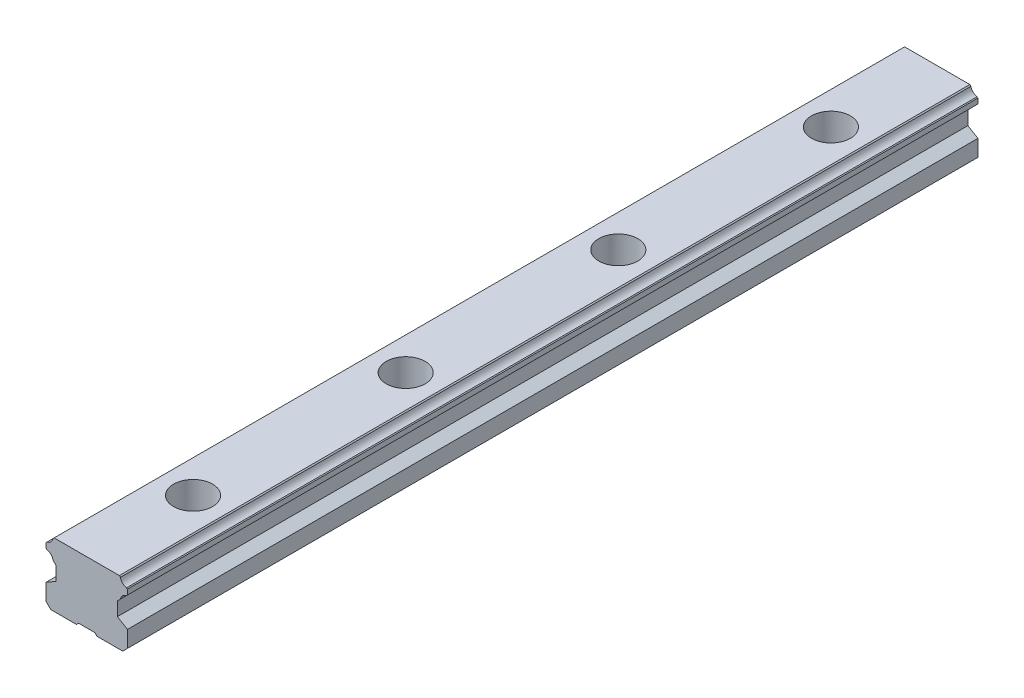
ISO-10303-21;
HEADER;
FILE_DESCRIPTION(('STEP AP214'),'2;1');
FILE_NAME('part.step','',(''),(''),'','','');
FILE_SCHEMA(('AUTOMOTIVE_DESIGN { 1 0 10303 214 1 1 1 1 }'));
ENDSEC;
DATA;
#1=APPLICATION_CONTEXT('core data for automotive mechanical design processes');
#2=APPLICATION_PROTOCOL_DEFINITION('international standard','automotive_design',2000,#1);
#3=PRODUCT_CONTEXT('',#1,'mechanical');
#4=PRODUCT('Part','Part','',(#3));
#5=PRODUCT_RELATED_PRODUCT_CATEGORY('part','',(#4));
#6=PRODUCT_DEFINITION_FORMATION('','',#4);
#7=PRODUCT_DEFINITION_CONTEXT('part definition',#1,'design');
#8=PRODUCT_DEFINITION('design','',#6,#7);
#9=PRODUCT_DEFINITION_SHAPE('','',#8);
#10=(LENGTH_UNIT() NAMED_UNIT(*) SI_UNIT(.MILLI.,.METRE.));
#11=(NAMED_UNIT(*) PLANE_ANGLE_UNIT() SI_UNIT($,.RADIAN.));
#12=(NAMED_UNIT(*) SI_UNIT($,.STERADIAN.) SOLID_ANGLE_UNIT());
#13=UNCERTAINTY_MEASURE_WITH_UNIT(LENGTH_MEASURE(1.E-05),#10,'distance_accuracy_value','');
#14=(GEOMETRIC_REPRESENTATION_CONTEXT(3) GLOBAL_UNCERTAINTY_ASSIGNED_CONTEXT((#13)) GLOBAL_UNIT_ASSIGNED_CONTEXT((#10,
#11,#12)) REPRESENTATION_CONTEXT('',''));
#15=CARTESIAN_POINT('',(0.,0.,0.));
#16=DIRECTION('',(0.,0.,1.));
#17=DIRECTION('',(1.,0.,0.));
#18=AXIS2_PLACEMENT_3D('',#15,#16,#17);
#19=CARTESIAN_POINT('',(-2.8999996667,-33.,-208.040407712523));
#20=DIRECTION('',(0.707106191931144,-0.70710737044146,0.));
#21=DIRECTION('',(0.70710737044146,0.707106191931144,0.));
#22=AXIS2_PLACEMENT_3D('',#19,#20,#21);
#23=PLANE('',#22);
#24=DIRECTION('',(-3.49413454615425E-09,-3.49412876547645E-09,-1.));
#25=VECTOR('',#24,1.);
#26=CARTESIAN_POINT('',(-2.89999947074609,-32.9999998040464,-151.959592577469));
#27=LINE('',#26,#25);
#28=CARTESIAN_POINT('',(-2.8999996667,-33.,-208.040407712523));
#29=VERTEX_POINT('',#28);
#30=CARTESIAN_POINT('',(-2.89999947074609,-32.9999998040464,-151.959592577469));
#31=VERTEX_POINT('',#30);
#32=EDGE_CURVE('E313',#29,#31,#27,.F.);
#33=ORIENTED_EDGE('',*,*,#32,.F.);
#34=CARTESIAN_POINT('',(-2.8999996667,-33.,-208.040407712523));
#35=CARTESIAN_POINT('',(-2.72300815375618,-32.8230087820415,-207.778478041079));
#36=CARTESIAN_POINT('',(-2.52082043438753,-32.6208213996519,-207.554332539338));
#37=CARTESIAN_POINT('',(-2.29999840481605,-32.3999997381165,-207.361817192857));
#38=B_SPLINE_CURVE_WITH_KNOTS('',3,(#34,#35,#36,#37),.UNSPECIFIED.,.F.,.F.,(4,4),(0.,1.),.UNSPECIFIED.);
#39=CARTESIAN_POINT('',(-2.29999840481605,-32.3999997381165,-207.361817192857));
#40=VERTEX_POINT('',#39);
#41=EDGE_CURVE('E300',#29,#40,#38,.T.);
#42=ORIENTED_EDGE('',*,*,#41,.T.);
#43=DIRECTION('',(-4.76734591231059E-09,-4.76733795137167E-09,1.));
#44=VECTOR('',#43,1.);
#45=CARTESIAN_POINT('',(-2.29999840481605,-32.3999997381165,-207.361817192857));
#46=LINE('',#45,#44);
#47=CARTESIAN_POINT('',(-2.29999866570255,-32.3999999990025,-152.638182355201));
#48=VERTEX_POINT('',#47);
#49=EDGE_CURVE('E312',#40,#48,#46,.T.);
#50=ORIENTED_EDGE('',*,*,#49,.T.);
#51=CARTESIAN_POINT('',(-2.29999866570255,-32.3999999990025,-152.638182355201));
#52=CARTESIAN_POINT('',(-2.52082051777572,-32.6208214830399,-152.44566724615));
#53=CARTESIAN_POINT('',(-2.72300808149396,-32.8230087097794,-152.221521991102));
#54=CARTESIAN_POINT('',(-2.89999947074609,-32.9999998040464,-151.959592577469));
#55=B_SPLINE_CURVE_WITH_KNOTS('',3,(#51,#52,#53,#54),.UNSPECIFIED.,.F.,.F.,(4,4),(0.,1.),.UNSPECIFIED.);
#56=EDGE_CURVE('E327',#48,#31,#55,.T.);
#57=ORIENTED_EDGE('',*,*,#56,.T.);
#58=EDGE_LOOP('',(#33,#42,#50,#57));
#59=FACE_BOUND('',#58,.T.);
#60=ADVANCED_FACE('F16',(#59),#23,.T.);
#61=CARTESIAN_POINT('',(-2.8999996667,-33.,-240.));
#62=DIRECTION('',(0.707106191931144,-0.70710737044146,0.));
#63=DIRECTION('',(0.70710737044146,0.707106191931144,0.));
#64=AXIS2_PLACEMENT_3D('',#61,#62,#63);
#65=PLANE('',#64);
#66=DIRECTION('',(3.64584382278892E-11,3.6458340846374E-11,1.));
#67=VECTOR('',#66,1.);
#68=CARTESIAN_POINT('',(-2.2999986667,-32.4,-240.));
#69=LINE('',#68,#67);
#70=CARTESIAN_POINT('',(-2.2999986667,-32.4,-240.));
#71=VERTEX_POINT('',#70);
#72=CARTESIAN_POINT('',(-2.29999866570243,-32.3999999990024,-212.638182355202));
#73=VERTEX_POINT('',#72);
#74=EDGE_CURVE('E354',#71,#73,#69,.T.);
#75=ORIENTED_EDGE('',*,*,#74,.T.);
#76=CARTESIAN_POINT('',(-2.29999866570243,-32.3999999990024,-212.638182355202));
#77=CARTESIAN_POINT('',(-2.52082051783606,-32.6208214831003,-212.445667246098));
#78=CARTESIAN_POINT('',(-2.72300808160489,-32.8230087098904,-212.221521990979));
#79=CARTESIAN_POINT('',(-2.89999947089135,-32.9999998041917,-211.959592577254));
#80=B_SPLINE_CURVE_WITH_KNOTS('',3,(#76,#77,#78,#79),.UNSPECIFIED.,.F.,.F.,(4,4),(0.,1.),.UNSPECIFIED.);
#81=CARTESIAN_POINT('',(-2.89999947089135,-32.9999998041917,-211.959592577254));
#82=VERTEX_POINT('',#81);
#83=EDGE_CURVE('E362',#73,#82,#80,.T.);
#84=ORIENTED_EDGE('',*,*,#83,.T.);
#85=DIRECTION('',(-6.98308864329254E-09,-6.9830770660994E-09,-1.));
#86=VECTOR('',#85,1.);
#87=CARTESIAN_POINT('',(-2.89999947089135,-32.9999998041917,-211.959592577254));
#88=LINE('',#87,#86);
#89=CARTESIAN_POINT('',(-2.8999996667,-33.,-240.));
#90=VERTEX_POINT('',#89);
#91=EDGE_CURVE('E322',#90,#82,#88,.F.);
#92=ORIENTED_EDGE('',*,*,#91,.F.);
#93=DIRECTION('',(0.70710737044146,0.707106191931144,0.));
#94=VECTOR('',#93,1.);
#95=CARTESIAN_POINT('',(-2.8999996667,-33.,-240.));
#96=LINE('',#95,#94);
#97=EDGE_CURVE('E376',#90,#71,#96,.T.);
#98=ORIENTED_EDGE('',*,*,#97,.T.);
#99=EDGE_LOOP('',(#75,#84,#92,#98));
#100=FACE_BOUND('',#99,.T.);
#101=ADVANCED_FACE('F346',(#100),#65,.T.);
#102=CARTESIAN_POINT('',(2.29999866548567,-32.3999999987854,-240.));
#103=DIRECTION('',(-0.707106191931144,-0.70710737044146,0.));
#104=DIRECTION('',(0.70710737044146,-0.707106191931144,0.));
#105=AXIS2_PLACEMENT_3D('',#102,#103,#104);
#106=PLANE('',#105);
#107=DIRECTION('',(0.,0.,1.));
#108=VECTOR('',#107,1.);
#109=CARTESIAN_POINT('',(2.8999996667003,-33.,-240.));
#110=LINE('',#109,#108);
#111=CARTESIAN_POINT('',(2.8999996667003,-33.,-240.));
#112=VERTEX_POINT('',#111);
#113=CARTESIAN_POINT('',(2.89999966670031,-33.,-211.959592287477));
#114=VERTEX_POINT('',#113);
#115=EDGE_CURVE('E381',#112,#114,#110,.T.);
#116=ORIENTED_EDGE('',*,*,#115,.T.);
#117=CARTESIAN_POINT('',(2.89999966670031,-33.,-211.959592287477));
#118=CARTESIAN_POINT('',(2.72300823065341,-32.8230088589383,-212.221521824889));
#119=CARTESIAN_POINT('',(2.52082059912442,-32.6208215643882,-212.445667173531));
#120=CARTESIAN_POINT('',(2.29999866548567,-32.3999999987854,-212.63818235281));
#121=B_SPLINE_CURVE_WITH_KNOTS('',3,(#117,#118,#119,#120),.UNSPECIFIED.,.F.,.F.,(4,4),(0.,1.),.UNSPECIFIED.);
#122=CARTESIAN_POINT('',(2.29999866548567,-32.3999999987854,-212.63818235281));
#123=VERTEX_POINT('',#122);
#124=EDGE_CURVE('E386',#114,#123,#121,.T.);
#125=ORIENTED_EDGE('',*,*,#124,.T.);
#126=DIRECTION('',(4.43915746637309E-11,-4.43914285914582E-11,-1.));
#127=VECTOR('',#126,1.);
#128=CARTESIAN_POINT('',(2.29999866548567,-32.3999999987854,-212.63818235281));
#129=LINE('',#128,#127);
#130=CARTESIAN_POINT('',(2.2999986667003,-32.4,-240.));
#131=VERTEX_POINT('',#130);
#132=EDGE_CURVE('E397',#131,#123,#129,.F.);
#133=ORIENTED_EDGE('',*,*,#132,.F.);
#134=DIRECTION('',(0.70710737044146,-0.707106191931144,0.));
#135=VECTOR('',#134,1.);
#136=CARTESIAN_POINT('',(2.2999986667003,-32.4,-240.));
#137=LINE('',#136,#135);
#138=EDGE_CURVE('E1658',#131,#112,#137,.T.);
#139=ORIENTED_EDGE('',*,*,#138,.T.);
#140=EDGE_LOOP('',(#116,#125,#133,#139));
#141=FACE_BOUND('',#140,.T.);
#142=ADVANCED_FACE('F399',(#141),#106,.T.);
#143=CARTESIAN_POINT('',(2.29999866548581,-32.3999999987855,-208.040407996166));
#144=DIRECTION('',(-0.707106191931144,-0.70710737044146,0.));
#145=DIRECTION('',(0.70710737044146,-0.707106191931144,0.));
#146=AXIS2_PLACEMENT_3D('',#143,#144,#145);
#147=PLANE('',#146);
#148=DIRECTION('',(4.19228234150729E-12,-4.19220930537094E-12,-1.));
#149=VECTOR('',#148,1.);
#150=CARTESIAN_POINT('',(2.29999866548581,-32.3999999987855,-152.63818235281));
#151=LINE('',#150,#149);
#152=CARTESIAN_POINT('',(2.29999866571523,-32.3999999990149,-207.361817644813));
#153=VERTEX_POINT('',#152);
#154=CARTESIAN_POINT('',(2.29999866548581,-32.3999999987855,-152.63818235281));
#155=VERTEX_POINT('',#154);
#156=EDGE_CURVE('E1656',#153,#155,#151,.F.);
#157=ORIENTED_EDGE('',*,*,#156,.F.);
#158=CARTESIAN_POINT('',(2.29999866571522,-32.3999999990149,-207.361817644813));
#159=CARTESIAN_POINT('',(2.52082059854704,-32.6208215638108,-207.554332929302));
#160=CARTESIAN_POINT('',(2.7230082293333,-32.8230088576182,-207.778478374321));
#161=CARTESIAN_POINT('',(2.89999966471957,-32.9999999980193,-208.040407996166));
#162=B_SPLINE_CURVE_WITH_KNOTS('',3,(#158,#159,#160,#161),.UNSPECIFIED.,.F.,.F.,(4,4),(0.,1.),.UNSPECIFIED.);
#163=CARTESIAN_POINT('',(2.89999966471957,-32.9999999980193,-208.040407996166));
#164=VERTEX_POINT('',#163);
#165=EDGE_CURVE('E1645',#153,#164,#162,.T.);
#166=ORIENTED_EDGE('',*,*,#165,.T.);
#167=DIRECTION('',(3.5319172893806E-11,-3.5319085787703E-11,1.));
#168=VECTOR('',#167,1.);
#169=CARTESIAN_POINT('',(2.89999966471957,-32.9999999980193,-208.040407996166));
#170=LINE('',#169,#168);
#171=CARTESIAN_POINT('',(2.8999996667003,-33.,-151.959592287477));
#172=VERTEX_POINT('',#171);
#173=EDGE_CURVE('E1655',#164,#172,#170,.T.);
#174=ORIENTED_EDGE('',*,*,#173,.T.);
#175=CARTESIAN_POINT('',(2.8999996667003,-33.,-151.959592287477));
#176=CARTESIAN_POINT('',(2.72300823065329,-32.8230088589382,-152.221521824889));
#177=CARTESIAN_POINT('',(2.52082059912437,-32.6208215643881,-152.445667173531));
#178=CARTESIAN_POINT('',(2.29999866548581,-32.3999999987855,-152.63818235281));
#179=B_SPLINE_CURVE_WITH_KNOTS('',3,(#175,#176,#177,#178),.UNSPECIFIED.,.F.,.F.,(4,4),(0.,1.),.UNSPECIFIED.);
#180=EDGE_CURVE('E435',#172,#155,#179,.T.);
#181=ORIENTED_EDGE('',*,*,#180,.T.);
#182=EDGE_LOOP('',(#157,#166,#174,#181));
#183=FACE_BOUND('',#182,.T.);
#184=ADVANCED_FACE('F408',(#183),#147,.T.);
#185=CARTESIAN_POINT('',(-2.29999866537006,-32.4,-152.63818235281));
#186=DIRECTION('',(0.,-1.,0.));
#187=DIRECTION('',(0.,0.,-1.));
#188=AXIS2_PLACEMENT_3D('',#185,#186,#187);
#189=PLANE('',#188);
#190=ORIENTED_EDGE('',*,*,#49,.F.);
#191=CARTESIAN_POINT('',(0.,-32.4,-210.));
#192=DIRECTION('',(0.,1.,0.));
#193=DIRECTION('',(0.,0.,1.));
#194=AXIS2_PLACEMENT_3D('',#191,#192,#193);
#195=CIRCLE('',#194,3.5);
#196=EDGE_CURVE('E306',#40,#153,#195,.T.);
#197=ORIENTED_EDGE('',*,*,#196,.T.);
#198=ORIENTED_EDGE('',*,*,#156,.T.);
#199=CARTESIAN_POINT('',(0.,-32.4,-150.));
#200=DIRECTION('',(0.,1.,0.));
#201=DIRECTION('',(1.95698568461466E-10,0.,-1.));
#202=AXIS2_PLACEMENT_3D('',#199,#200,#201);
#203=CIRCLE('',#202,3.5);
#204=EDGE_CURVE('E434',#155,#48,#203,.T.);
#205=ORIENTED_EDGE('',*,*,#204,.T.);
#206=EDGE_LOOP('',(#190,#197,#198,#205));
#207=FACE_BOUND('',#206,.T.);
#208=ADVANCED_FACE('F412',(#207),#189,.T.);
#209=CARTESIAN_POINT('',(-2.8999996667,-33.,-148.040407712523));
#210=DIRECTION('',(0.707106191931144,-0.70710737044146,0.));
#211=DIRECTION('',(0.70710737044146,0.707106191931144,0.));
#212=AXIS2_PLACEMENT_3D('',#209,#210,#211);
#213=PLANE('',#212);
#214=DIRECTION('',(-3.49416245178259E-09,-3.49415663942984E-09,-1.));
#215=VECTOR('',#214,1.);
#216=CARTESIAN_POINT('',(-2.89999947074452,-32.9999998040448,-91.9595925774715));
#217=LINE('',#216,#215);
#218=CARTESIAN_POINT('',(-2.8999996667,-33.,-148.040407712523));
#219=VERTEX_POINT('',#218);
#220=CARTESIAN_POINT('',(-2.89999947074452,-32.9999998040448,-91.9595925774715));
#221=VERTEX_POINT('',#220);
#222=EDGE_CURVE('E440',#219,#221,#217,.F.);
#223=ORIENTED_EDGE('',*,*,#222,.F.);
#224=CARTESIAN_POINT('',(-2.8999996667,-33.,-148.040407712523));
#225=CARTESIAN_POINT('',(-2.72300815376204,-32.8230087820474,-147.778478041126));
#226=CARTESIAN_POINT('',(-2.52082043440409,-32.6208213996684,-147.554332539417));
#227=CARTESIAN_POINT('',(-2.29999840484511,-32.3999997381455,-147.361817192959));
#228=B_SPLINE_CURVE_WITH_KNOTS('',3,(#224,#225,#226,#227),.UNSPECIFIED.,.F.,.F.,(4,4),(0.,1.),.UNSPECIFIED.);
#229=CARTESIAN_POINT('',(-2.29999840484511,-32.3999997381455,-147.361817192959));
#230=VERTEX_POINT('',#229);
#231=EDGE_CURVE('E445',#219,#230,#228,.T.);
#232=ORIENTED_EDGE('',*,*,#231,.T.);
#233=DIRECTION('',(-4.76658992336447E-09,-4.7665820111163E-09,1.));
#234=VECTOR('',#233,1.);
#235=CARTESIAN_POINT('',(-2.29999840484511,-32.3999997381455,-147.361817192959));
#236=LINE('',#235,#234);
#237=CARTESIAN_POINT('',(-2.29999866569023,-32.3999999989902,-92.6381823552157));
#238=VERTEX_POINT('',#237);
#239=EDGE_CURVE('E457',#230,#238,#236,.T.);
#240=ORIENTED_EDGE('',*,*,#239,.T.);
#241=CARTESIAN_POINT('',(-2.29999866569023,-32.3999999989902,-92.6381823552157));
#242=CARTESIAN_POINT('',(-2.52082051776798,-32.6208214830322,-92.4456672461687));
#243=CARTESIAN_POINT('',(-2.72300808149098,-32.8230087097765,-92.2215219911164));
#244=CARTESIAN_POINT('',(-2.89999947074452,-32.9999998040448,-91.9595925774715));
#245=B_SPLINE_CURVE_WITH_KNOTS('',3,(#241,#242,#243,#244),.UNSPECIFIED.,.F.,.F.,(4,4),(0.,1.),.UNSPECIFIED.);
#246=EDGE_CURVE('E487',#238,#221,#245,.T.);
#247=ORIENTED_EDGE('',*,*,#246,.T.);
#248=EDGE_LOOP('',(#223,#232,#240,#247));
#249=FACE_BOUND('',#248,.T.);
#250=ADVANCED_FACE('F459',(#249),#213,.T.);
#251=CARTESIAN_POINT('',(2.29999866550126,-32.399999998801,-148.040407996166));
#252=DIRECTION('',(-0.707106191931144,-0.70710737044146,0.));
#253=DIRECTION('',(0.70710737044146,-0.707106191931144,0.));
#254=AXIS2_PLACEMENT_3D('',#251,#252,#253);
#255=PLANE('',#254);
#256=DIRECTION('',(3.30003232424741E-12,-3.30006478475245E-12,-1.));
#257=VECTOR('',#256,1.);
#258=CARTESIAN_POINT('',(2.29999866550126,-32.399999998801,-92.638182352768));
#259=LINE('',#258,#257);
#260=CARTESIAN_POINT('',(2.29999866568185,-32.3999999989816,-147.361817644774));
#261=VERTEX_POINT('',#260);
#262=CARTESIAN_POINT('',(2.29999866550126,-32.399999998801,-92.638182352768));
#263=VERTEX_POINT('',#262);
#264=EDGE_CURVE('E478',#261,#263,#259,.F.);
#265=ORIENTED_EDGE('',*,*,#264,.F.);
#266=CARTESIAN_POINT('',(2.29999866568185,-32.3999999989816,-147.361817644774));
#267=CARTESIAN_POINT('',(2.52082059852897,-32.6208215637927,-147.554332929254));
#268=CARTESIAN_POINT('',(2.72300822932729,-32.8230088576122,-147.778478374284));
#269=CARTESIAN_POINT('',(2.89999966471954,-32.9999999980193,-148.040407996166));
#270=B_SPLINE_CURVE_WITH_KNOTS('',3,(#266,#267,#268,#269),.UNSPECIFIED.,.F.,.F.,(4,4),(0.,1.),.UNSPECIFIED.);
#271=CARTESIAN_POINT('',(2.89999966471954,-32.9999999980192,-148.040407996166));
#272=VERTEX_POINT('',#271);
#273=EDGE_CURVE('E486',#261,#272,#270,.T.);
#274=ORIENTED_EDGE('',*,*,#273,.T.);
#275=DIRECTION('',(3.53195925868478E-11,-3.53195925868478E-11,1.));
#276=VECTOR('',#275,1.);
#277=CARTESIAN_POINT('',(2.89999966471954,-32.9999999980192,-148.040407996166));
#278=LINE('',#277,#276);
#279=CARTESIAN_POINT('',(2.89999966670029,-33.,-91.9595922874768));
#280=VERTEX_POINT('',#279);
#281=EDGE_CURVE('E499',#272,#280,#278,.T.);
#282=ORIENTED_EDGE('',*,*,#281,.T.);
#283=CARTESIAN_POINT('',(2.89999966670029,-33.,-91.9595922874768));
#284=CARTESIAN_POINT('',(2.72300823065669,-32.8230088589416,-92.2215218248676));
#285=CARTESIAN_POINT('',(2.52082059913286,-32.6208215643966,-92.445667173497));
#286=CARTESIAN_POINT('',(2.29999866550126,-32.399999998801,-92.638182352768));
#287=B_SPLINE_CURVE_WITH_KNOTS('',3,(#283,#284,#285,#286),.UNSPECIFIED.,.F.,.F.,(4,4),(0.,1.),.UNSPECIFIED.);
#288=EDGE_CURVE('E506',#280,#263,#287,.T.);
#289=ORIENTED_EDGE('',*,*,#288,.T.);
#290=EDGE_LOOP('',(#265,#274,#282,#289));
#291=FACE_BOUND('',#290,.T.);
#292=ADVANCED_FACE('F468',(#291),#255,.T.);
#293=CARTESIAN_POINT('',(-2.29999866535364,-32.4,-92.638182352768));
#294=DIRECTION('',(0.,-1.,0.));
#295=DIRECTION('',(0.,0.,-1.));
#296=AXIS2_PLACEMENT_3D('',#293,#294,#295);
#297=PLANE('',#296);
#298=ORIENTED_EDGE('',*,*,#239,.F.);
#299=CARTESIAN_POINT('',(0.,-32.4,-150.));
#300=DIRECTION('',(0.,1.,0.));
#301=DIRECTION('',(0.,0.,1.));
#302=AXIS2_PLACEMENT_3D('',#299,#300,#301);
#303=CIRCLE('',#302,3.5);
#304=EDGE_CURVE('E514',#230,#261,#303,.T.);
#305=ORIENTED_EDGE('',*,*,#304,.T.);
#306=ORIENTED_EDGE('',*,*,#264,.T.);
#307=CARTESIAN_POINT('',(0.,-32.4,-90.));
#308=DIRECTION('',(0.,1.,0.));
#309=DIRECTION('',(1.9811619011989E-10,0.,-1.));
#310=AXIS2_PLACEMENT_3D('',#307,#308,#309);
#311=CIRCLE('',#310,3.5);
#312=EDGE_CURVE('E522',#263,#238,#311,.T.);
#313=ORIENTED_EDGE('',*,*,#312,.T.);
#314=EDGE_LOOP('',(#298,#305,#306,#313));
#315=FACE_BOUND('',#314,.T.);
#316=ADVANCED_FACE('F557',(#315),#297,.T.);
#317=CARTESIAN_POINT('',(-2.89999966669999,-33.,-88.0404077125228));
#318=DIRECTION('',(0.707106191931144,-0.70710737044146,0.));
#319=DIRECTION('',(0.70710737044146,0.707106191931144,0.));
#320=AXIS2_PLACEMENT_3D('',#317,#318,#319);
#321=PLANE('',#320);
#322=DIRECTION('',(-7.64512049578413E-10,-7.64510822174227E-10,-1.));
#323=VECTOR('',#322,1.);
#324=CARTESIAN_POINT('',(-2.89999962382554,-32.9999999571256,-31.9595923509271));
#325=LINE('',#324,#323);
#326=CARTESIAN_POINT('',(-2.89999966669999,-33.,-88.0404077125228));
#327=VERTEX_POINT('',#326);
#328=CARTESIAN_POINT('',(-2.89999962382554,-32.9999999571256,-31.9595923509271));
#329=VERTEX_POINT('',#328);
#330=EDGE_CURVE('E527',#327,#329,#325,.F.);
#331=ORIENTED_EDGE('',*,*,#330,.F.);
#332=CARTESIAN_POINT('',(-2.89999966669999,-33.,-88.0404077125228));
#333=CARTESIAN_POINT('',(-2.72300815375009,-32.8230087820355,-87.7784780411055));
#334=CARTESIAN_POINT('',(-2.52082043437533,-32.6208213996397,-87.5543325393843));
#335=CARTESIAN_POINT('',(-2.29999840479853,-32.399999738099,-87.3618171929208));
#336=B_SPLINE_CURVE_WITH_KNOTS('',3,(#332,#333,#334,#335),.UNSPECIFIED.,.F.,.F.,(4,4),(0.,1.),.UNSPECIFIED.);
#337=CARTESIAN_POINT('',(-2.29999840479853,-32.399999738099,-87.3618171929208));
#338=VERTEX_POINT('',#337);
#339=EDGE_CURVE('E532',#327,#338,#336,.T.);
#340=ORIENTED_EDGE('',*,*,#339,.T.);
#341=DIRECTION('',(-4.76761960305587E-09,-4.7676116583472E-09,1.));
#342=VECTOR('',#341,1.);
#343=CARTESIAN_POINT('',(-2.29999840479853,-32.399999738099,-87.3618171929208));
#344=LINE('',#343,#342);
#345=CARTESIAN_POINT('',(-2.29999866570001,-32.399999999,-32.6381823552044));
#346=VERTEX_POINT('',#345);
#347=EDGE_CURVE('E545',#338,#346,#344,.T.);
#348=ORIENTED_EDGE('',*,*,#347,.T.);
#349=CARTESIAN_POINT('',(-2.29999866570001,-32.399999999,-32.6381823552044));
#350=CARTESIAN_POINT('',(-2.52082058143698,-32.6208215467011,-32.4456671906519));
#351=CARTESIAN_POINT('',(-2.72300819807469,-32.82300882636,-32.2215218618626));
#352=CARTESIAN_POINT('',(-2.89999962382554,-32.9999999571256,-31.9595923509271));
#353=B_SPLINE_CURVE_WITH_KNOTS('',3,(#349,#350,#351,#352),.UNSPECIFIED.,.F.,.F.,(4,4),(0.,1.),.UNSPECIFIED.);
#354=EDGE_CURVE('E576',#346,#329,#353,.T.);
#355=ORIENTED_EDGE('',*,*,#354,.T.);
#356=EDGE_LOOP('',(#331,#340,#348,#355));
#357=FACE_BOUND('',#356,.T.);
#358=ADVANCED_FACE('F547',(#357),#321,.T.);
#359=CARTESIAN_POINT('',(2.29999866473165,-32.3999999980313,-88.0404079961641));
#360=DIRECTION('',(-0.707106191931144,-0.70710737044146,0.));
#361=DIRECTION('',(0.70710737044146,-0.707106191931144,0.));
#362=AXIS2_PLACEMENT_3D('',#359,#360,#361);
#363=PLANE('',#362);
#364=DIRECTION('',(1.75720967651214E-11,-1.75720399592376E-11,-1.));
#365=VECTOR('',#364,1.);
#366=CARTESIAN_POINT('',(2.29999866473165,-32.3999999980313,-32.638182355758));
#367=LINE('',#366,#365);
#368=CARTESIAN_POINT('',(2.29999866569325,-32.399999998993,-87.3618176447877));
#369=VERTEX_POINT('',#368);
#370=CARTESIAN_POINT('',(2.29999866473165,-32.3999999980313,-32.638182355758));
#371=VERTEX_POINT('',#370);
#372=EDGE_CURVE('E567',#369,#371,#367,.F.);
#373=ORIENTED_EDGE('',*,*,#372,.F.);
#374=CARTESIAN_POINT('',(2.29999866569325,-32.399999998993,-87.3618176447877));
#375=CARTESIAN_POINT('',(2.5208205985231,-32.6208215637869,-87.5543329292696));
#376=CARTESIAN_POINT('',(2.72300822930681,-32.8230088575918,-87.7784783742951));
#377=CARTESIAN_POINT('',(2.89999966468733,-32.999999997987,-88.0404079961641));
#378=B_SPLINE_CURVE_WITH_KNOTS('',3,(#374,#375,#376,#377),.UNSPECIFIED.,.F.,.F.,(4,4),(0.,1.),.UNSPECIFIED.);
#379=CARTESIAN_POINT('',(2.89999966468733,-32.999999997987,-88.0404079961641));
#380=VERTEX_POINT('',#379);
#381=EDGE_CURVE('E575',#369,#380,#378,.T.);
#382=ORIENTED_EDGE('',*,*,#381,.T.);
#383=DIRECTION('',(3.58940019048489E-11,-3.58939227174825E-11,1.));
#384=VECTOR('',#383,1.);
#385=CARTESIAN_POINT('',(2.89999966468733,-32.999999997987,-88.0404079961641));
#386=LINE('',#385,#384);
#387=CARTESIAN_POINT('',(2.89999966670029,-33.,-31.9595922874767));
#388=VERTEX_POINT('',#387);
#389=EDGE_CURVE('E588',#380,#388,#386,.T.);
#390=ORIENTED_EDGE('',*,*,#389,.T.);
#391=CARTESIAN_POINT('',(2.89999966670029,-33.,-31.9595922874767));
#392=CARTESIAN_POINT('',(2.72300823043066,-32.8230088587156,-32.2215218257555));
#393=CARTESIAN_POINT('',(2.52082059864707,-32.6208215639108,-32.445667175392));
#394=CARTESIAN_POINT('',(2.29999866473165,-32.3999999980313,-32.638182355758));
#395=B_SPLINE_CURVE_WITH_KNOTS('',3,(#391,#392,#393,#394),.UNSPECIFIED.,.F.,.F.,(4,4),(0.,1.),.UNSPECIFIED.);
#396=EDGE_CURVE('E595',#388,#371,#395,.T.);
#397=ORIENTED_EDGE('',*,*,#396,.T.);
#398=EDGE_LOOP('',(#373,#382,#390,#397));
#399=FACE_BOUND('',#398,.T.);
#400=ADVANCED_FACE('F556',(#399),#363,.T.);
#401=CARTESIAN_POINT('',(-2.29999866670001,-32.4,-32.6381823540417));
#402=DIRECTION('',(0.,-1.,0.));
#403=DIRECTION('',(0.,0.,-1.));
#404=AXIS2_PLACEMENT_3D('',#401,#402,#403);
#405=PLANE('',#404);
#406=ORIENTED_EDGE('',*,*,#347,.F.);
#407=CARTESIAN_POINT('',(0.,-32.4,-90.));
#408=DIRECTION('',(0.,1.,0.));
#409=DIRECTION('',(0.,0.,1.));
#410=AXIS2_PLACEMENT_3D('',#407,#408,#409);
#411=CIRCLE('',#410,3.5);
#412=EDGE_CURVE('E603',#338,#369,#411,.T.);
#413=ORIENTED_EDGE('',*,*,#412,.T.);
#414=ORIENTED_EDGE('',*,*,#372,.T.);
#415=CARTESIAN_POINT('',(0.,-32.4,-30.));
#416=DIRECTION('',(0.,1.,0.));
#417=DIRECTION('',(0.,0.,-1.));
#418=AXIS2_PLACEMENT_3D('',#415,#416,#417);
#419=CIRCLE('',#418,3.5);
#420=EDGE_CURVE('E611',#371,#346,#419,.T.);
#421=ORIENTED_EDGE('',*,*,#420,.T.);
#422=EDGE_LOOP('',(#406,#413,#414,#421));
#423=FACE_BOUND('',#422,.T.);
#424=ADVANCED_FACE('F646',(#423),#405,.T.);
#425=CARTESIAN_POINT('',(-2.8999996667,-33.,-28.0404077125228));
#426=DIRECTION('',(0.707106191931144,-0.70710737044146,0.));
#427=DIRECTION('',(0.70710737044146,0.707106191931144,0.));
#428=AXIS2_PLACEMENT_3D('',#425,#426,#427);
#429=PLANE('',#428);
#430=DIRECTION('',(0.,0.,-1.));
#431=VECTOR('',#430,1.);
#432=CARTESIAN_POINT('',(-2.8999996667,-33.,0.));
#433=LINE('',#432,#431);
#434=CARTESIAN_POINT('',(-2.89999966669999,-33.,-28.0404077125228));
#435=VERTEX_POINT('',#434);
#436=CARTESIAN_POINT('',(-2.8999996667,-33.,0.));
#437=VERTEX_POINT('',#436);
#438=EDGE_CURVE('E616',#435,#437,#433,.F.);
#439=ORIENTED_EDGE('',*,*,#438,.F.);
#440=CARTESIAN_POINT('',(-2.89999966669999,-33.,-28.0404077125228));
#441=CARTESIAN_POINT('',(-2.72300823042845,-32.8230088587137,-27.7784781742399));
#442=CARTESIAN_POINT('',(-2.52082059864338,-32.6208215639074,-27.5543328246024));
#443=CARTESIAN_POINT('',(-2.29999866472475,-32.3999999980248,-27.361817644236));
#444=B_SPLINE_CURVE_WITH_KNOTS('',3,(#440,#441,#442,#443),.UNSPECIFIED.,.F.,.F.,(4,4),(0.,1.),.UNSPECIFIED.);
#445=CARTESIAN_POINT('',(-2.29999866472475,-32.3999999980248,-27.361817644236));
#446=VERTEX_POINT('',#445);
#447=EDGE_CURVE('E621',#435,#446,#444,.T.);
#448=ORIENTED_EDGE('',*,*,#447,.T.);
#449=DIRECTION('',(-7.21899559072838E-11,-7.21898260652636E-11,1.));
#450=VECTOR('',#449,1.);
#451=CARTESIAN_POINT('',(-2.29999866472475,-32.3999999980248,-27.361817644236));
#452=LINE('',#451,#450);
#453=CARTESIAN_POINT('',(-2.2999986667,-32.4,0.));
#454=VERTEX_POINT('',#453);
#455=EDGE_CURVE('E634',#446,#454,#452,.T.);
#456=ORIENTED_EDGE('',*,*,#455,.T.);
#457=DIRECTION('',(-0.70710737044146,-0.707106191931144,0.));
#458=VECTOR('',#457,1.);
#459=CARTESIAN_POINT('',(-2.2999986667,-32.4,0.));
#460=LINE('',#459,#458);
#461=EDGE_CURVE('E1787',#437,#454,#460,.F.);
#462=ORIENTED_EDGE('',*,*,#461,.F.);
#463=EDGE_LOOP('',(#439,#448,#456,#462));
#464=FACE_BOUND('',#463,.T.);
#465=ADVANCED_FACE('F636',(#464),#429,.T.);
#466=CARTESIAN_POINT('',(-2.2999986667,-32.4,0.));
#467=DIRECTION('',(0.,-1.,0.));
#468=DIRECTION('',(0.,0.,-1.));
#469=AXIS2_PLACEMENT_3D('',#466,#467,#468);
#470=PLANE('',#469);
#471=ORIENTED_EDGE('',*,*,#455,.F.);
#472=CARTESIAN_POINT('',(0.,-32.4,-30.));
#473=DIRECTION('',(0.,1.,0.));
#474=DIRECTION('',(0.,0.,1.));
#475=AXIS2_PLACEMENT_3D('',#472,#473,#474);
#476=CIRCLE('',#475,3.5);
#477=CARTESIAN_POINT('',(2.29999866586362,-32.4,-27.3618176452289));
#478=VERTEX_POINT('',#477);
#479=EDGE_CURVE('E1789',#446,#478,#476,.T.);
#480=ORIENTED_EDGE('',*,*,#479,.T.);
#481=DIRECTION('',(3.05787371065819E-11,0.,1.));
#482=VECTOR('',#481,1.);
#483=CARTESIAN_POINT('',(2.29999866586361,-32.4,-27.3618176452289));
#484=LINE('',#483,#482);
#485=CARTESIAN_POINT('',(2.2999986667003,-32.4,0.));
#486=VERTEX_POINT('',#485);
#487=EDGE_CURVE('E1792',#478,#486,#484,.T.);
#488=ORIENTED_EDGE('',*,*,#487,.T.);
#489=DIRECTION('',(-1.,0.,0.));
#490=VECTOR('',#489,1.);
#491=CARTESIAN_POINT('',(2.2999986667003,-32.4,0.));
#492=LINE('',#491,#490);
#493=EDGE_CURVE('E1802',#454,#486,#492,.F.);
#494=ORIENTED_EDGE('',*,*,#493,.F.);
#495=EDGE_LOOP('',(#471,#480,#488,#494));
#496=FACE_BOUND('',#495,.T.);
#497=ADVANCED_FACE('F645',(#496),#470,.T.);
#498=CARTESIAN_POINT('',(2.29999866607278,-32.3999999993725,-28.0404076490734));
#499=DIRECTION('',(-0.707106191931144,-0.70710737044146,0.));
#500=DIRECTION('',(0.70710737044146,-0.707106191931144,0.));
#501=AXIS2_PLACEMENT_3D('',#498,#499,#500);
#502=PLANE('',#501);
#503=ORIENTED_EDGE('',*,*,#487,.F.);
#504=CARTESIAN_POINT('',(2.29999866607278,-32.3999999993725,-27.3618176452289));
#505=CARTESIAN_POINT('',(2.52082058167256,-32.6208215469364,-27.5543328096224));
#506=CARTESIAN_POINT('',(2.72300819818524,-32.8230088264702,-27.7784781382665));
#507=CARTESIAN_POINT('',(2.89999962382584,-32.9999999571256,-28.0404076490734));
#508=B_SPLINE_CURVE_WITH_KNOTS('',3,(#504,#505,#506,#507),.UNSPECIFIED.,.F.,.F.,(4,4),(0.,1.),.UNSPECIFIED.);
#509=CARTESIAN_POINT('',(2.89999962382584,-32.9999999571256,-28.0404076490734));
#510=VERTEX_POINT('',#509);
#511=EDGE_CURVE('E673',#478,#510,#508,.T.);
#512=ORIENTED_EDGE('',*,*,#511,.T.);
#513=DIRECTION('',(1.52902422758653E-09,-1.52902164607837E-09,1.));
#514=VECTOR('',#513,1.);
#515=CARTESIAN_POINT('',(2.89999962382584,-32.9999999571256,-28.0404076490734));
#516=LINE('',#515,#514);
#517=CARTESIAN_POINT('',(2.8999996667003,-33.,0.));
#518=VERTEX_POINT('',#517);
#519=EDGE_CURVE('E664',#510,#518,#516,.T.);
#520=ORIENTED_EDGE('',*,*,#519,.T.);
#521=DIRECTION('',(-0.70710737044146,0.707106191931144,0.));
#522=VECTOR('',#521,1.);
#523=CARTESIAN_POINT('',(2.8999996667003,-33.,0.));
#524=LINE('',#523,#522);
#525=EDGE_CURVE('E672',#486,#518,#524,.F.);
#526=ORIENTED_EDGE('',*,*,#525,.F.);
#527=EDGE_LOOP('',(#503,#512,#520,#526));
#528=FACE_BOUND('',#527,.T.);
#529=ADVANCED_FACE('F649',(#528),#502,.T.);
#530=CARTESIAN_POINT('',(-11.5,-31.650002,-240.));
#531=DIRECTION('',(-1.,0.,0.));
#532=DIRECTION('',(0.,0.,1.));
#533=AXIS2_PLACEMENT_3D('',#530,#531,#532);
#534=PLANE('',#533);
#535=DIRECTION('',(0.,1.,0.));
#536=VECTOR('',#535,1.);
#537=CARTESIAN_POINT('',(-11.5,-31.650002,0.));
#538=LINE('',#537,#536);
#539=CARTESIAN_POINT('',(-11.5,-27.,0.));
#540=VERTEX_POINT('',#539);
#541=CARTESIAN_POINT('',(-11.5,-31.650002,0.));
#542=VERTEX_POINT('',#541);
#543=EDGE_CURVE('E677',#540,#542,#538,.F.);
#544=ORIENTED_EDGE('',*,*,#543,.F.);
#545=DIRECTION('',(0.,0.,-1.));
#546=VECTOR('',#545,1.);
#547=CARTESIAN_POINT('',(-11.5,-27.,0.));
#548=LINE('',#547,#546);
#549=CARTESIAN_POINT('',(-11.5,-27.,-240.));
#550=VERTEX_POINT('',#549);
#551=EDGE_CURVE('E681',#550,#540,#548,.F.);
#552=ORIENTED_EDGE('',*,*,#551,.F.);
#553=DIRECTION('',(0.,-1.,0.));
#554=VECTOR('',#553,1.);
#555=CARTESIAN_POINT('',(-11.5,-27.,-240.));
#556=LINE('',#555,#554);
#557=CARTESIAN_POINT('',(-11.5,-31.650002,-240.));
#558=VERTEX_POINT('',#557);
#559=EDGE_CURVE('E686',#550,#558,#556,.T.);
#560=ORIENTED_EDGE('',*,*,#559,.T.);
#561=DIRECTION('',(0.,0.,1.));
#562=VECTOR('',#561,1.);
#563=CARTESIAN_POINT('',(-11.5,-31.650002,-240.));
#564=LINE('',#563,#562);
#565=EDGE_CURVE('E691',#558,#542,#564,.T.);
#566=ORIENTED_EDGE('',*,*,#565,.T.);
#567=EDGE_LOOP('',(#544,#552,#560,#566));
#568=FACE_BOUND('',#567,.T.);
#569=ADVANCED_FACE('F654',(#568),#534,.T.);
#570=CARTESIAN_POINT('',(-11.5,-31.650002,-240.));
#571=DIRECTION('',(-0.707107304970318,-0.707106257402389,0.));
#572=DIRECTION('',(0.707106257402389,-0.707107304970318,0.));
#573=AXIS2_PLACEMENT_3D('',#570,#571,#572);
#574=PLANE('',#573);
#575=DIRECTION('',(-0.707106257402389,0.707107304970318,0.));
#576=VECTOR('',#575,1.);
#577=CARTESIAN_POINT('',(-10.150004,-33.,0.));
#578=LINE('',#577,#576);
#579=CARTESIAN_POINT('',(-10.150004,-33.,0.));
#580=VERTEX_POINT('',#579);
#581=EDGE_CURVE('E696',#542,#580,#578,.F.);
#582=ORIENTED_EDGE('',*,*,#581,.F.);
#583=ORIENTED_EDGE('',*,*,#565,.F.);
#584=DIRECTION('',(0.70710625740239,-0.707107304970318,0.));
#585=VECTOR('',#584,1.);
#586=CARTESIAN_POINT('',(-11.5,-31.650002,-240.));
#587=LINE('',#586,#585);
#588=CARTESIAN_POINT('',(-10.150004,-33.,-240.));
#589=VERTEX_POINT('',#588);
#590=EDGE_CURVE('E700',#558,#589,#587,.T.);
#591=ORIENTED_EDGE('',*,*,#590,.T.);
#592=DIRECTION('',(0.,0.,1.));
#593=VECTOR('',#592,1.);
#594=CARTESIAN_POINT('',(-10.150004,-33.,-240.));
#595=LINE('',#594,#593);
#596=EDGE_CURVE('E324',#589,#580,#595,.T.);
#597=ORIENTED_EDGE('',*,*,#596,.T.);
#598=EDGE_LOOP('',(#582,#583,#591,#597));
#599=FACE_BOUND('',#598,.T.);
#600=ADVANCED_FACE('F1187',(#599),#574,.T.);
#601=CARTESIAN_POINT('',(-10.150004,-33.,0.));
#602=DIRECTION('',(0.,-1.,0.));
#603=DIRECTION('',(0.,0.,-1.));
#604=AXIS2_PLACEMENT_3D('',#601,#602,#603);
#605=PLANE('',#604);
#606=ORIENTED_EDGE('',*,*,#91,.T.);
#607=CARTESIAN_POINT('',(0.,-33.,-210.));
#608=DIRECTION('',(0.,1.,0.));
#609=DIRECTION('',(-0.828571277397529,0.,-0.559883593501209));
#610=AXIS2_PLACEMENT_3D('',#607,#608,#609);
#611=CIRCLE('',#610,3.5);
#612=EDGE_CURVE('E303',#29,#82,#611,.F.);
#613=ORIENTED_EDGE('',*,*,#612,.F.);
#614=ORIENTED_EDGE('',*,*,#32,.T.);
#615=CARTESIAN_POINT('',(0.,-33.,-150.));
#616=DIRECTION('',(0.,1.,0.));
#617=DIRECTION('',(-0.828571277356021,0.,-0.559883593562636));
#618=AXIS2_PLACEMENT_3D('',#615,#616,#617);
#619=CIRCLE('',#618,3.5);
#620=EDGE_CURVE('E323',#219,#31,#619,.F.);
#621=ORIENTED_EDGE('',*,*,#620,.F.);
#622=ORIENTED_EDGE('',*,*,#222,.T.);
#623=CARTESIAN_POINT('',(0.,-33.,-90.));
#624=DIRECTION('',(0.,1.,0.));
#625=DIRECTION('',(-0.828571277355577,0.,-0.559883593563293));
#626=AXIS2_PLACEMENT_3D('',#623,#624,#625);
#627=CIRCLE('',#626,3.5);
#628=EDGE_CURVE('E714',#327,#221,#627,.F.);
#629=ORIENTED_EDGE('',*,*,#628,.F.);
#630=ORIENTED_EDGE('',*,*,#330,.T.);
#631=CARTESIAN_POINT('',(0.,-33.,-30.));
#632=DIRECTION('',(0.,1.,0.));
#633=DIRECTION('',(-0.828571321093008,0.,-0.559883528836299));
#634=AXIS2_PLACEMENT_3D('',#631,#632,#633);
#635=CIRCLE('',#634,3.5);
#636=EDGE_CURVE('E718',#435,#329,#635,.F.);
#637=ORIENTED_EDGE('',*,*,#636,.F.);
#638=ORIENTED_EDGE('',*,*,#438,.T.);
#639=DIRECTION('',(-1.,0.,0.));
#640=VECTOR('',#639,1.);
#641=CARTESIAN_POINT('',(-2.8999996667,-33.,0.));
#642=LINE('',#641,#640);
#643=EDGE_CURVE('E722',#580,#437,#642,.F.);
#644=ORIENTED_EDGE('',*,*,#643,.F.);
#645=ORIENTED_EDGE('',*,*,#596,.F.);
#646=DIRECTION('',(1.,0.,0.));
#647=VECTOR('',#646,1.);
#648=CARTESIAN_POINT('',(-10.150004,-33.,-240.));
#649=LINE('',#648,#647);
#650=EDGE_CURVE('E726',#589,#90,#649,.T.);
#651=ORIENTED_EDGE('',*,*,#650,.T.);
#652=EDGE_LOOP('',(#606,#613,#614,#621,#622,#629,#630,#637,#638,#644,#645,#651));
#653=FACE_BOUND('',#652,.T.);
#654=ADVANCED_FACE('F318',(#653),#605,.T.);
#655=CARTESIAN_POINT('',(-2.2999986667,-32.4,-212.63818235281));
#656=DIRECTION('',(0.,-1.,0.));
#657=DIRECTION('',(0.,0.,-1.));
#658=AXIS2_PLACEMENT_3D('',#655,#656,#657);
#659=PLANE('',#658);
#660=CARTESIAN_POINT('',(0.,-32.4,-210.));
#661=DIRECTION('',(0.,1.,0.));
#662=DIRECTION('',(1.95698695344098E-10,0.,-1.));
#663=AXIS2_PLACEMENT_3D('',#660,#661,#662);
#664=CIRCLE('',#663,3.5);
#665=EDGE_CURVE('E730',#123,#73,#664,.T.);
#666=ORIENTED_EDGE('',*,*,#665,.T.);
#667=ORIENTED_EDGE('',*,*,#74,.F.);
#668=DIRECTION('',(1.,0.,0.));
#669=VECTOR('',#668,1.);
#670=CARTESIAN_POINT('',(-2.2999986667,-32.4,-240.));
#671=LINE('',#670,#669);
#672=EDGE_CURVE('E735',#71,#131,#671,.T.);
#673=ORIENTED_EDGE('',*,*,#672,.T.);
#674=ORIENTED_EDGE('',*,*,#132,.T.);
#675=EDGE_LOOP('',(#666,#667,#673,#674));
#676=FACE_BOUND('',#675,.T.);
#677=ADVANCED_FACE('F1200',(#676),#659,.T.);
#678=CARTESIAN_POINT('',(2.89999962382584,-33.,0.));
#679=DIRECTION('',(0.,-1.,0.));
#680=DIRECTION('',(0.,0.,-1.));
#681=AXIS2_PLACEMENT_3D('',#678,#679,#680);
#682=PLANE('',#681);
#683=ORIENTED_EDGE('',*,*,#173,.F.);
#684=CARTESIAN_POINT('',(0.,-33.,-210.));
#685=DIRECTION('',(0.,1.,0.));
#686=DIRECTION('',(0.828571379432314,0.,0.559883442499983));
#687=AXIS2_PLACEMENT_3D('',#684,#685,#686);
#688=CIRCLE('',#687,3.5);
#689=EDGE_CURVE('E740',#114,#164,#688,.F.);
#690=ORIENTED_EDGE('',*,*,#689,.F.);
#691=ORIENTED_EDGE('',*,*,#115,.F.);
#692=DIRECTION('',(1.,0.,0.));
#693=VECTOR('',#692,1.);
#694=CARTESIAN_POINT('',(2.8999996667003,-33.,-240.));
#695=LINE('',#694,#693);
#696=CARTESIAN_POINT('',(10.150004,-33.,-240.));
#697=VERTEX_POINT('',#696);
#698=EDGE_CURVE('E744',#112,#697,#695,.T.);
#699=ORIENTED_EDGE('',*,*,#698,.T.);
#700=DIRECTION('',(0.,0.,1.));
#701=VECTOR('',#700,1.);
#702=CARTESIAN_POINT('',(10.150004,-33.,-240.));
#703=LINE('',#702,#701);
#704=CARTESIAN_POINT('',(10.150004,-33.,0.));
#705=VERTEX_POINT('',#704);
#706=EDGE_CURVE('E749',#697,#705,#703,.T.);
#707=ORIENTED_EDGE('',*,*,#706,.T.);
#708=DIRECTION('',(-1.,0.,0.));
#709=VECTOR('',#708,1.);
#710=CARTESIAN_POINT('',(10.150004,-33.,0.));
#711=LINE('',#710,#709);
#712=EDGE_CURVE('E754',#518,#705,#711,.F.);
#713=ORIENTED_EDGE('',*,*,#712,.F.);
#714=ORIENTED_EDGE('',*,*,#519,.F.);
#715=CARTESIAN_POINT('',(0.,-33.,-30.));
#716=DIRECTION('',(0.,1.,0.));
#717=DIRECTION('',(0.828571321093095,0.,0.559883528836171));
#718=AXIS2_PLACEMENT_3D('',#715,#716,#717);
#719=CIRCLE('',#718,3.5);
#720=EDGE_CURVE('E758',#388,#510,#719,.F.);
#721=ORIENTED_EDGE('',*,*,#720,.F.);
#722=ORIENTED_EDGE('',*,*,#389,.F.);
#723=CARTESIAN_POINT('',(0.,-33.,-90.));
#724=DIRECTION('',(0.,1.,0.));
#725=DIRECTION('',(0.828571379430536,0.,0.559883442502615));
#726=AXIS2_PLACEMENT_3D('',#723,#724,#725);
#727=CIRCLE('',#726,3.5);
#728=EDGE_CURVE('E762',#280,#380,#727,.F.);
#729=ORIENTED_EDGE('',*,*,#728,.F.);
#730=ORIENTED_EDGE('',*,*,#281,.F.);
#731=CARTESIAN_POINT('',(0.,-33.,-150.));
#732=DIRECTION('',(0.,1.,0.));
#733=DIRECTION('',(0.828571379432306,0.,0.559883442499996));
#734=AXIS2_PLACEMENT_3D('',#731,#732,#733);
#735=CIRCLE('',#734,3.5);
#736=EDGE_CURVE('E766',#172,#272,#735,.F.);
#737=ORIENTED_EDGE('',*,*,#736,.F.);
#738=EDGE_LOOP('',(#683,#690,#691,#699,#707,#713,#714,#721,#722,#729,#730,#737));
#739=FACE_BOUND('',#738,.T.);
#740=ADVANCED_FACE('F1143',(#739),#682,.T.);
#741=CARTESIAN_POINT('',(10.150004,-33.,-240.));
#742=DIRECTION('',(0.707107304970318,-0.707106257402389,0.));
#743=DIRECTION('',(0.707106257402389,0.707107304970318,0.));
#744=AXIS2_PLACEMENT_3D('',#741,#742,#743);
#745=PLANE('',#744);
#746=DIRECTION('',(-0.707106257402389,-0.707107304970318,0.));
#747=VECTOR('',#746,1.);
#748=CARTESIAN_POINT('',(11.5,-31.650002,0.));
#749=LINE('',#748,#747);
#750=CARTESIAN_POINT('',(11.5,-31.650002,0.));
#751=VERTEX_POINT('',#750);
#752=EDGE_CURVE('E770',#705,#751,#749,.F.);
#753=ORIENTED_EDGE('',*,*,#752,.F.);
#754=ORIENTED_EDGE('',*,*,#706,.F.);
#755=DIRECTION('',(0.707106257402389,0.707107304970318,0.));
#756=VECTOR('',#755,1.);
#757=CARTESIAN_POINT('',(10.150004,-33.,-240.));
#758=LINE('',#757,#756);
#759=CARTESIAN_POINT('',(11.5,-31.650002,-240.));
#760=VERTEX_POINT('',#759);
#761=EDGE_CURVE('E774',#697,#760,#758,.T.);
#762=ORIENTED_EDGE('',*,*,#761,.T.);
#763=DIRECTION('',(0.,0.,1.));
#764=VECTOR('',#763,1.);
#765=CARTESIAN_POINT('',(11.5,-31.650002,-240.));
#766=LINE('',#765,#764);
#767=EDGE_CURVE('E779',#760,#751,#766,.T.);
#768=ORIENTED_EDGE('',*,*,#767,.T.);
#769=EDGE_LOOP('',(#753,#754,#762,#768));
#770=FACE_BOUND('',#769,.T.);
#771=ADVANCED_FACE('F1214',(#770),#745,.T.);
#772=CARTESIAN_POINT('',(11.5,-31.650002,0.));
#773=DIRECTION('',(1.,0.,0.));
#774=DIRECTION('',(0.,0.,-1.));
#775=AXIS2_PLACEMENT_3D('',#772,#773,#774);
#776=PLANE('',#775);
#777=DIRECTION('',(0.,-1.,0.));
#778=VECTOR('',#777,1.);
#779=CARTESIAN_POINT('',(11.5,-27.,0.));
#780=LINE('',#779,#778);
#781=CARTESIAN_POINT('',(11.5,-27.,0.));
#782=VERTEX_POINT('',#781);
#783=EDGE_CURVE('E784',#751,#782,#780,.F.);
#784=ORIENTED_EDGE('',*,*,#783,.F.);
#785=ORIENTED_EDGE('',*,*,#767,.F.);
#786=DIRECTION('',(0.,1.,0.));
#787=VECTOR('',#786,1.);
#788=CARTESIAN_POINT('',(11.5,-31.650002,-240.));
#789=LINE('',#788,#787);
#790=CARTESIAN_POINT('',(11.5,-27.,-240.));
#791=VERTEX_POINT('',#790);
#792=EDGE_CURVE('E788',#760,#791,#789,.T.);
#793=ORIENTED_EDGE('',*,*,#792,.T.);
#794=DIRECTION('',(0.,0.,1.));
#795=VECTOR('',#794,1.);
#796=CARTESIAN_POINT('',(11.5,-27.,-240.));
#797=LINE('',#796,#795);
#798=EDGE_CURVE('E793',#791,#782,#797,.T.);
#799=ORIENTED_EDGE('',*,*,#798,.T.);
#800=EDGE_LOOP('',(#784,#785,#793,#799));
#801=FACE_BOUND('',#800,.T.);
#802=ADVANCED_FACE('F1221',(#801),#776,.T.);
#803=CARTESIAN_POINT('',(11.5,-27.,-240.));
#804=DIRECTION('',(0.499999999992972,0.866025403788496,0.));
#805=DIRECTION('',(-0.866025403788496,0.499999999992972,0.));
#806=AXIS2_PLACEMENT_3D('',#803,#804,#805);
#807=PLANE('',#806);
#808=DIRECTION('',(0.866025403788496,-0.499999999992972,0.));
#809=VECTOR('',#808,1.);
#810=CARTESIAN_POINT('',(8.6300000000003,-25.343004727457,0.));
#811=LINE('',#810,#809);
#812=CARTESIAN_POINT('',(8.6300000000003,-25.343004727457,0.));
#813=VERTEX_POINT('',#812);
#814=EDGE_CURVE('E798',#782,#813,#811,.F.);
#815=ORIENTED_EDGE('',*,*,#814,.F.);
#816=ORIENTED_EDGE('',*,*,#798,.F.);
#817=DIRECTION('',(-0.866025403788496,0.499999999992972,0.));
#818=VECTOR('',#817,1.);
#819=CARTESIAN_POINT('',(11.5,-27.,-240.));
#820=LINE('',#819,#818);
#821=CARTESIAN_POINT('',(8.6300000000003,-25.343004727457,-240.));
#822=VERTEX_POINT('',#821);
#823=EDGE_CURVE('E802',#791,#822,#820,.T.);
#824=ORIENTED_EDGE('',*,*,#823,.T.);
#825=DIRECTION('',(0.,0.,1.));
#826=VECTOR('',#825,1.);
#827=CARTESIAN_POINT('',(8.6300000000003,-25.343004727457,-240.));
#828=LINE('',#827,#826);
#829=EDGE_CURVE('E807',#822,#813,#828,.T.);
#830=ORIENTED_EDGE('',*,*,#829,.T.);
#831=EDGE_LOOP('',(#815,#816,#824,#830));
#832=FACE_BOUND('',#831,.T.);
#833=ADVANCED_FACE('F1229',(#832),#807,.T.);
#834=CARTESIAN_POINT('',(8.6300000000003,-25.343004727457,0.));
#835=DIRECTION('',(1.,0.,0.));
#836=DIRECTION('',(0.,0.,-1.));
#837=AXIS2_PLACEMENT_3D('',#834,#835,#836);
#838=PLANE('',#837);
#839=DIRECTION('',(0.,-1.,0.));
#840=VECTOR('',#839,1.);
#841=CARTESIAN_POINT('',(8.6300000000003,-21.478974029,0.));
#842=LINE('',#841,#840);
#843=CARTESIAN_POINT('',(8.6300000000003,-21.478974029,0.));
#844=VERTEX_POINT('',#843);
#845=EDGE_CURVE('E812',#813,#844,#842,.F.);
#846=ORIENTED_EDGE('',*,*,#845,.F.);
#847=ORIENTED_EDGE('',*,*,#829,.F.);
#848=DIRECTION('',(0.,1.,0.));
#849=VECTOR('',#848,1.);
#850=CARTESIAN_POINT('',(8.6300000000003,-25.343004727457,-240.));
#851=LINE('',#850,#849);
#852=CARTESIAN_POINT('',(8.6300000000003,-21.478974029,-240.));
#853=VERTEX_POINT('',#852);
#854=EDGE_CURVE('E816',#822,#853,#851,.T.);
#855=ORIENTED_EDGE('',*,*,#854,.T.);
#856=DIRECTION('',(0.,0.,1.));
#857=VECTOR('',#856,1.);
#858=CARTESIAN_POINT('',(8.6300000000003,-21.478974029,-240.));
#859=LINE('',#858,#857);
#860=EDGE_CURVE('E821',#853,#844,#859,.T.);
#861=ORIENTED_EDGE('',*,*,#860,.T.);
#862=EDGE_LOOP('',(#846,#847,#855,#861));
#863=FACE_BOUND('',#862,.T.);
#864=ADVANCED_FACE('F1237',(#863),#838,.T.);
#865=CARTESIAN_POINT('',(8.6300000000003,-21.478974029,-240.));
#866=DIRECTION('',(0.707106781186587,-0.707106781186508,0.));
#867=DIRECTION('',(0.707106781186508,0.707106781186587,0.));
#868=AXIS2_PLACEMENT_3D('',#865,#866,#867);
#869=PLANE('',#868);
#870=DIRECTION('',(-0.707106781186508,-0.707106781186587,0.));
#871=VECTOR('',#870,1.);
#872=CARTESIAN_POINT('',(9.5027216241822,-20.606252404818,0.));
#873=LINE('',#872,#871);
#874=CARTESIAN_POINT('',(9.5027216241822,-20.606252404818,0.));
#875=VERTEX_POINT('',#874);
#876=EDGE_CURVE('E826',#844,#875,#873,.F.);
#877=ORIENTED_EDGE('',*,*,#876,.F.);
#878=ORIENTED_EDGE('',*,*,#860,.F.);
#879=DIRECTION('',(0.707106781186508,0.707106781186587,0.));
#880=VECTOR('',#879,1.);
#881=CARTESIAN_POINT('',(8.6300000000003,-21.478974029,-240.));
#882=LINE('',#881,#880);
#883=CARTESIAN_POINT('',(9.5027216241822,-20.606252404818,-240.));
#884=VERTEX_POINT('',#883);
#885=EDGE_CURVE('E830',#853,#884,#882,.T.);
#886=ORIENTED_EDGE('',*,*,#885,.T.);
#887=DIRECTION('',(0.,0.,1.));
#888=VECTOR('',#887,1.);
#889=CARTESIAN_POINT('',(9.5027216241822,-20.606252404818,-240.));
#890=LINE('',#889,#888);
#891=EDGE_CURVE('E835',#884,#875,#890,.T.);
#892=ORIENTED_EDGE('',*,*,#891,.T.);
#893=EDGE_LOOP('',(#877,#878,#886,#892));
#894=FACE_BOUND('',#893,.T.);
#895=ADVANCED_FACE('F1245',(#894),#869,.T.);
#896=CARTESIAN_POINT('',(11.6562149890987,-21.0562149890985,-240.));
#897=DIRECTION('',(0.,0.,1.));
#898=DIRECTION('',(-0.204528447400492,0.978860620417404,0.));
#899=AXIS2_PLACEMENT_3D('',#896,#897,#898);
#900=CYLINDRICAL_SURFACE('',#899,2.19999999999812);
#901=CARTESIAN_POINT('',(11.6562149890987,-21.0562149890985,0.));
#902=DIRECTION('',(0.,0.,1.));
#903=DIRECTION('',(-0.204528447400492,0.978860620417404,0.));
#904=AXIS2_PLACEMENT_3D('',#901,#902,#903);
#905=CIRCLE('',#904,2.19999999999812);
#906=CARTESIAN_POINT('',(11.206252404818,-18.902721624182,0.));
#907=VERTEX_POINT('',#906);
#908=EDGE_CURVE('E840',#907,#875,#905,.T.);
#909=ORIENTED_EDGE('',*,*,#908,.T.);
#910=ORIENTED_EDGE('',*,*,#891,.F.);
#911=CARTESIAN_POINT('',(11.6562149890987,-21.0562149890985,-240.));
#912=DIRECTION('',(0.,0.,-1.));
#913=DIRECTION('',(-0.978860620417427,0.204528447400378,0.));
#914=AXIS2_PLACEMENT_3D('',#911,#912,#913);
#915=CIRCLE('',#914,2.19999999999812);
#916=CARTESIAN_POINT('',(11.206252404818,-18.902721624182,-240.));
#917=VERTEX_POINT('',#916);
#918=EDGE_CURVE('E845',#917,#884,#915,.F.);
#919=ORIENTED_EDGE('',*,*,#918,.F.);
#920=DIRECTION('',(0.,0.,1.));
#921=VECTOR('',#920,1.);
#922=CARTESIAN_POINT('',(11.206252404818,-18.902721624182,-240.));
#923=LINE('',#922,#921);
#924=EDGE_CURVE('E849',#917,#907,#923,.T.);
#925=ORIENTED_EDGE('',*,*,#924,.T.);
#926=EDGE_LOOP('',(#909,#910,#919,#925));
#927=FACE_BOUND('',#926,.T.);
#928=ADVANCED_FACE('F1253',(#927),#900,.F.);
#929=CARTESIAN_POINT('',(11.206252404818,-18.902721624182,-240.));
#930=DIRECTION('',(0.707106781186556,-0.707106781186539,0.));
#931=DIRECTION('',(0.707106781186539,0.707106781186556,0.));
#932=AXIS2_PLACEMENT_3D('',#929,#930,#931);
#933=PLANE('',#932);
#934=DIRECTION('',(-0.707106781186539,-0.707106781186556,0.));
#935=VECTOR('',#934,1.);
#936=CARTESIAN_POINT('',(11.43,-18.678974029,0.));
#937=LINE('',#936,#935);
#938=CARTESIAN_POINT('',(11.43,-18.678974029,0.));
#939=VERTEX_POINT('',#938);
#940=EDGE_CURVE('E854',#907,#939,#937,.F.);
#941=ORIENTED_EDGE('',*,*,#940,.F.);
#942=ORIENTED_EDGE('',*,*,#924,.F.);
#943=DIRECTION('',(0.707106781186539,0.707106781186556,0.));
#944=VECTOR('',#943,1.);
#945=CARTESIAN_POINT('',(11.206252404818,-18.902721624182,-240.));
#946=LINE('',#945,#944);
#947=CARTESIAN_POINT('',(11.43,-18.678974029,-240.));
#948=VERTEX_POINT('',#947);
#949=EDGE_CURVE('E858',#917,#948,#946,.T.);
#950=ORIENTED_EDGE('',*,*,#949,.T.);
#951=DIRECTION('',(0.,0.,1.));
#952=VECTOR('',#951,1.);
#953=CARTESIAN_POINT('',(11.43,-18.678974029,-240.));
#954=LINE('',#953,#952);
#955=EDGE_CURVE('E863',#948,#939,#954,.T.);
#956=ORIENTED_EDGE('',*,*,#955,.T.);
#957=EDGE_LOOP('',(#941,#942,#950,#956));
#958=FACE_BOUND('',#957,.T.);
#959=ADVANCED_FACE('F1261',(#958),#933,.T.);
#960=CARTESIAN_POINT('',(11.43,-18.678974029,0.));
#961=DIRECTION('',(1.,0.,0.));
#962=DIRECTION('',(0.,0.,-1.));
#963=AXIS2_PLACEMENT_3D('',#960,#961,#962);
#964=PLANE('',#963);
#965=DIRECTION('',(0.,-1.,0.));
#966=VECTOR('',#965,1.);
#967=CARTESIAN_POINT('',(11.43,-17.221025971,0.));
#968=LINE('',#967,#966);
#969=CARTESIAN_POINT('',(11.43,-17.221025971,0.));
#970=VERTEX_POINT('',#969);
#971=EDGE_CURVE('E868',#939,#970,#968,.F.);
#972=ORIENTED_EDGE('',*,*,#971,.F.);
#973=ORIENTED_EDGE('',*,*,#955,.F.);
#974=DIRECTION('',(0.,1.,0.));
#975=VECTOR('',#974,1.);
#976=CARTESIAN_POINT('',(11.43,-18.678974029,-240.));
#977=LINE('',#976,#975);
#978=CARTESIAN_POINT('',(11.43,-17.221025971,-240.));
#979=VERTEX_POINT('',#978);
#980=EDGE_CURVE('E872',#948,#979,#977,.T.);
#981=ORIENTED_EDGE('',*,*,#980,.T.);
#982=DIRECTION('',(0.,0.,1.));
#983=VECTOR('',#982,1.);
#984=CARTESIAN_POINT('',(11.43,-17.221025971,-240.));
#985=LINE('',#984,#983);
#986=EDGE_CURVE('E877',#979,#970,#985,.T.);
#987=ORIENTED_EDGE('',*,*,#986,.T.);
#988=EDGE_LOOP('',(#972,#973,#981,#987));
#989=FACE_BOUND('',#988,.T.);
#990=ADVANCED_FACE('F1269',(#989),#964,.T.);
#991=CARTESIAN_POINT('',(11.43,-17.221025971,-240.));
#992=DIRECTION('',(0.70710678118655,0.707106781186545,0.));
#993=DIRECTION('',(-0.707106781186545,0.70710678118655,0.));
#994=AXIS2_PLACEMENT_3D('',#991,#992,#993);
#995=PLANE('',#994);
#996=DIRECTION('',(0.707106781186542,-0.707106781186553,0.));
#997=VECTOR('',#996,1.);
#998=CARTESIAN_POINT('',(11.206252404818,-16.997278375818,0.));
#999=LINE('',#998,#997);
#1000=CARTESIAN_POINT('',(11.206252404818,-16.997278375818,0.));
#1001=VERTEX_POINT('',#1000);
#1002=EDGE_CURVE('E882',#970,#1001,#999,.F.);
#1003=ORIENTED_EDGE('',*,*,#1002,.F.);
#1004=ORIENTED_EDGE('',*,*,#986,.F.);
#1005=DIRECTION('',(-0.707106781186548,0.707106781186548,0.));
#1006=VECTOR('',#1005,1.);
#1007=CARTESIAN_POINT('',(11.43,-17.221025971,-240.));
#1008=LINE('',#1007,#1006);
#1009=CARTESIAN_POINT('',(11.206252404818,-16.997278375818,-240.));
#1010=VERTEX_POINT('',#1009);
#1011=EDGE_CURVE('E886',#979,#1010,#1008,.T.);
#1012=ORIENTED_EDGE('',*,*,#1011,.T.);
#1013=DIRECTION('',(0.,0.,1.));
#1014=VECTOR('',#1013,1.);
#1015=CARTESIAN_POINT('',(11.206252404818,-16.997278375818,-240.));
#1016=LINE('',#1015,#1014);
#1017=EDGE_CURVE('E891',#1010,#1001,#1016,.T.);
#1018=ORIENTED_EDGE('',*,*,#1017,.T.);
#1019=EDGE_LOOP('',(#1003,#1004,#1012,#1018));
#1020=FACE_BOUND('',#1019,.T.);
#1021=ADVANCED_FACE('F1277',(#1020),#995,.T.);
#1022=CARTESIAN_POINT('',(11.6562149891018,-14.8437850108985,-240.));
#1023=DIRECTION('',(0.,0.,1.));
#1024=DIRECTION('',(-0.978860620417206,-0.204528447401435,0.));
#1025=AXIS2_PLACEMENT_3D('',#1022,#1023,#1024);
#1026=CYLINDRICAL_SURFACE('',#1025,2.20000000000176);
#1027=CARTESIAN_POINT('',(11.6562149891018,-14.8437850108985,0.));
#1028=DIRECTION('',(0.,0.,1.));
#1029=DIRECTION('',(-0.978860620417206,-0.204528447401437,0.));
#1030=AXIS2_PLACEMENT_3D('',#1027,#1028,#1029);
#1031=CIRCLE('',#1030,2.20000000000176);
#1032=CARTESIAN_POINT('',(9.5027216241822,-15.293747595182,0.));
#1033=VERTEX_POINT('',#1032);
#1034=EDGE_CURVE('E896',#1033,#1001,#1031,.T.);
#1035=ORIENTED_EDGE('',*,*,#1034,.T.);
#1036=ORIENTED_EDGE('',*,*,#1017,.F.);
#1037=CARTESIAN_POINT('',(11.6562149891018,-14.8437850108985,-240.));
#1038=DIRECTION('',(0.,0.,-1.));
#1039=DIRECTION('',(-0.204528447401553,-0.978860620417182,0.));
#1040=AXIS2_PLACEMENT_3D('',#1037,#1038,#1039);
#1041=CIRCLE('',#1040,2.20000000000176);
#1042=CARTESIAN_POINT('',(9.5027216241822,-15.293747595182,-240.));
#1043=VERTEX_POINT('',#1042);
#1044=EDGE_CURVE('E901',#1043,#1010,#1041,.F.);
#1045=ORIENTED_EDGE('',*,*,#1044,.F.);
#1046=DIRECTION('',(0.,0.,1.));
#1047=VECTOR('',#1046,1.);
#1048=CARTESIAN_POINT('',(9.5027216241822,-15.293747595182,-240.));
#1049=LINE('',#1048,#1047);
#1050=EDGE_CURVE('E905',#1043,#1033,#1049,.T.);
#1051=ORIENTED_EDGE('',*,*,#1050,.T.);
#1052=EDGE_LOOP('',(#1035,#1036,#1045,#1051));
#1053=FACE_BOUND('',#1052,.T.);
#1054=ADVANCED_FACE('F1285',(#1053),#1026,.F.);
#1055=CARTESIAN_POINT('',(9.5027216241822,-15.293747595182,-240.));
#1056=DIRECTION('',(0.707106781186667,0.707106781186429,0.));
#1057=DIRECTION('',(-0.707106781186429,0.707106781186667,0.));
#1058=AXIS2_PLACEMENT_3D('',#1055,#1056,#1057);
#1059=PLANE('',#1058);
#1060=DIRECTION('',(0.70710678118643,-0.707106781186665,1.36833007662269E-13));
#1061=VECTOR('',#1060,1.);
#1062=CARTESIAN_POINT('',(9.2089740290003,-15.,0.));
#1063=LINE('',#1062,#1061);
#1064=CARTESIAN_POINT('',(9.2089740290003,-15.,0.));
#1065=VERTEX_POINT('',#1064);
#1066=EDGE_CURVE('E910',#1033,#1065,#1063,.F.);
#1067=ORIENTED_EDGE('',*,*,#1066,.F.);
#1068=ORIENTED_EDGE('',*,*,#1050,.F.);
#1069=DIRECTION('',(-0.707106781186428,0.707106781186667,0.));
#1070=VECTOR('',#1069,1.);
#1071=CARTESIAN_POINT('',(9.5027216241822,-15.293747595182,-240.));
#1072=LINE('',#1071,#1070);
#1073=CARTESIAN_POINT('',(9.2089740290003,-15.,-240.));
#1074=VERTEX_POINT('',#1073);
#1075=EDGE_CURVE('E914',#1043,#1074,#1072,.T.);
#1076=ORIENTED_EDGE('',*,*,#1075,.T.);
#1077=DIRECTION('',(0.,0.,1.));
#1078=VECTOR('',#1077,1.);
#1079=CARTESIAN_POINT('',(9.2089740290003,-15.,-240.));
#1080=LINE('',#1079,#1078);
#1081=EDGE_CURVE('E919',#1074,#1065,#1080,.T.);
#1082=ORIENTED_EDGE('',*,*,#1081,.T.);
#1083=EDGE_LOOP('',(#1067,#1068,#1076,#1082));
#1084=FACE_BOUND('',#1083,.T.);
#1085=ADVANCED_FACE('F1293',(#1084),#1059,.T.);
#1086=CARTESIAN_POINT('',(-9.2089740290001,-15.,-240.));
#1087=DIRECTION('',(0.,1.,0.));
#1088=DIRECTION('',(0.,0.,1.));
#1089=AXIS2_PLACEMENT_3D('',#1086,#1087,#1088);
#1090=PLANE('',#1089);
#1091=DIRECTION('',(1.,0.,0.));
#1092=VECTOR('',#1091,1.);
#1093=CARTESIAN_POINT('',(-9.2089740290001,-15.,0.));
#1094=LINE('',#1093,#1092);
#1095=CARTESIAN_POINT('',(-9.2089740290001,-15.,0.));
#1096=VERTEX_POINT('',#1095);
#1097=EDGE_CURVE('E924',#1065,#1096,#1094,.F.);
#1098=ORIENTED_EDGE('',*,*,#1097,.F.);
#1099=ORIENTED_EDGE('',*,*,#1081,.F.);
#1100=DIRECTION('',(-1.,0.,0.));
#1101=VECTOR('',#1100,1.);
#1102=CARTESIAN_POINT('',(9.2089740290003,-15.,-240.));
#1103=LINE('',#1102,#1101);
#1104=CARTESIAN_POINT('',(-9.2089740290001,-15.,-240.));
#1105=VERTEX_POINT('',#1104);
#1106=EDGE_CURVE('E928',#1074,#1105,#1103,.T.);
#1107=ORIENTED_EDGE('',*,*,#1106,.T.);
#1108=DIRECTION('',(0.,0.,1.));
#1109=VECTOR('',#1108,1.);
#1110=CARTESIAN_POINT('',(-9.2089740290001,-15.,-240.));
#1111=LINE('',#1110,#1109);
#1112=EDGE_CURVE('E933',#1105,#1096,#1111,.T.);
#1113=ORIENTED_EDGE('',*,*,#1112,.T.);
#1114=EDGE_LOOP('',(#1098,#1099,#1107,#1113));
#1115=FACE_BOUND('',#1114,.T.);
#1116=CARTESIAN_POINT('',(0.,-15.,-150.));
#1117=DIRECTION('',(0.,-1.,0.));
#1118=DIRECTION('',(-1.16706547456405E-09,0.,1.));
#1119=AXIS2_PLACEMENT_3D('',#1116,#1117,#1118);
#1120=CIRCLE('',#1119,5.5);
#1121=CARTESIAN_POINT('',(-6.41886011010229E-09,-15.,-144.5));
#1122=VERTEX_POINT('',#1121);
#1123=EDGE_CURVE('E938',#1122,#1122,#1120,.T.);
#1124=ORIENTED_EDGE('',*,*,#1123,.T.);
#1125=EDGE_LOOP('',(#1124));
#1126=FACE_BOUND('',#1125,.T.);
#1127=CARTESIAN_POINT('',(0.,-15.,-90.));
#1128=DIRECTION('',(0.,-1.,0.));
#1129=DIRECTION('',(-1.16918547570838E-09,0.,1.));
#1130=AXIS2_PLACEMENT_3D('',#1127,#1128,#1129);
#1131=CIRCLE('',#1130,5.5);
#1132=CARTESIAN_POINT('',(-6.43052011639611E-09,-15.,-84.5));
#1133=VERTEX_POINT('',#1132);
#1134=EDGE_CURVE('E943',#1133,#1133,#1131,.T.);
#1135=ORIENTED_EDGE('',*,*,#1134,.T.);
#1136=EDGE_LOOP('',(#1135));
#1137=FACE_BOUND('',#1136,.T.);
#1138=CARTESIAN_POINT('',(0.,-15.,-30.));
#1139=DIRECTION('',(0.,-1.,0.));
#1140=DIRECTION('',(-1.1686554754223E-09,0.,1.));
#1141=AXIS2_PLACEMENT_3D('',#1138,#1139,#1140);
#1142=CIRCLE('',#1141,5.5);
#1143=CARTESIAN_POINT('',(-6.42760511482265E-09,-15.,-24.5));
#1144=VERTEX_POINT('',#1143);
#1145=EDGE_CURVE('E946',#1144,#1144,#1142,.T.);
#1146=ORIENTED_EDGE('',*,*,#1145,.T.);
#1147=EDGE_LOOP('',(#1146));
#1148=FACE_BOUND('',#1147,.T.);
#1149=CARTESIAN_POINT('',(0.,-15.,-210.));
#1150=DIRECTION('',(0.,-1.,0.));
#1151=DIRECTION('',(-1.16706805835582E-09,0.,1.));
#1152=AXIS2_PLACEMENT_3D('',#1149,#1150,#1151);
#1153=CIRCLE('',#1152,5.5);
#1154=CARTESIAN_POINT('',(-6.418874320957E-09,-15.,-204.5));
#1155=VERTEX_POINT('',#1154);
#1156=EDGE_CURVE('E949',#1155,#1155,#1153,.T.);
#1157=ORIENTED_EDGE('',*,*,#1156,.T.);
#1158=EDGE_LOOP('',(#1157));
#1159=FACE_BOUND('',#1158,.T.);
#1160=ADVANCED_FACE('F1301',(#1115,#1126,#1137,#1148,#1159),#1090,.T.);
#1161=CARTESIAN_POINT('',(-9.2089740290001,-15.,-240.));
#1162=DIRECTION('',(-0.707106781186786,0.707106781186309,0.));
#1163=DIRECTION('',(-0.707106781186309,-0.707106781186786,0.));
#1164=AXIS2_PLACEMENT_3D('',#1161,#1162,#1163);
#1165=PLANE('',#1164);
#1166=DIRECTION('',(0.707106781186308,0.707106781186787,-1.36833007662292E-13));
#1167=VECTOR('',#1166,1.);
#1168=CARTESIAN_POINT('',(-9.5027216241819,-15.293747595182,0.));
#1169=LINE('',#1168,#1167);
#1170=CARTESIAN_POINT('',(-9.5027216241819,-15.293747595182,0.));
#1171=VERTEX_POINT('',#1170);
#1172=EDGE_CURVE('E952',#1096,#1171,#1169,.F.);
#1173=ORIENTED_EDGE('',*,*,#1172,.F.);
#1174=ORIENTED_EDGE('',*,*,#1112,.F.);
#1175=DIRECTION('',(-0.707106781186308,-0.707106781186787,0.));
#1176=VECTOR('',#1175,1.);
#1177=CARTESIAN_POINT('',(-9.2089740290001,-15.,-240.));
#1178=LINE('',#1177,#1176);
#1179=CARTESIAN_POINT('',(-9.5027216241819,-15.293747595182,-240.));
#1180=VERTEX_POINT('',#1179);
#1181=EDGE_CURVE('E954',#1105,#1180,#1178,.T.);
#1182=ORIENTED_EDGE('',*,*,#1181,.T.);
#1183=DIRECTION('',(0.,0.,1.));
#1184=VECTOR('',#1183,1.);
#1185=CARTESIAN_POINT('',(-9.5027216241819,-15.293747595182,-240.));
#1186=LINE('',#1185,#1184);
#1187=EDGE_CURVE('E959',#1180,#1171,#1186,.T.);
#1188=ORIENTED_EDGE('',*,*,#1187,.T.);
#1189=EDGE_LOOP('',(#1173,#1174,#1182,#1188));
#1190=FACE_BOUND('',#1189,.T.);
#1191=ADVANCED_FACE('F1309',(#1190),#1165,.T.);
#1192=CARTESIAN_POINT('',(-11.6562149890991,-14.8437850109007,-240.));
#1193=DIRECTION('',(0.,0.,1.));
#1194=DIRECTION('',(0.204528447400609,-0.978860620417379,0.));
#1195=AXIS2_PLACEMENT_3D('',#1192,#1193,#1194);
#1196=CYLINDRICAL_SURFACE('',#1195,2.19999999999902);
#1197=CARTESIAN_POINT('',(-11.6562149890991,-14.8437850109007,0.));
#1198=DIRECTION('',(0.,0.,1.));
#1199=DIRECTION('',(0.204528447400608,-0.978860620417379,0.));
#1200=AXIS2_PLACEMENT_3D('',#1197,#1198,#1199);
#1201=CIRCLE('',#1200,2.19999999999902);
#1202=CARTESIAN_POINT('',(-11.206252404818,-16.997278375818,0.));
#1203=VERTEX_POINT('',#1202);
#1204=EDGE_CURVE('E964',#1203,#1171,#1201,.T.);
#1205=ORIENTED_EDGE('',*,*,#1204,.T.);
#1206=ORIENTED_EDGE('',*,*,#1187,.F.);
#1207=CARTESIAN_POINT('',(-11.6562149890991,-14.8437850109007,-240.));
#1208=DIRECTION('',(0.,0.,-1.));
#1209=DIRECTION('',(0.978860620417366,-0.204528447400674,0.));
#1210=AXIS2_PLACEMENT_3D('',#1207,#1208,#1209);
#1211=CIRCLE('',#1210,2.19999999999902);
#1212=CARTESIAN_POINT('',(-11.206252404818,-16.997278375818,-240.));
#1213=VERTEX_POINT('',#1212);
#1214=EDGE_CURVE('E969',#1213,#1180,#1211,.F.);
#1215=ORIENTED_EDGE('',*,*,#1214,.F.);
#1216=DIRECTION('',(0.,0.,1.));
#1217=VECTOR('',#1216,1.);
#1218=CARTESIAN_POINT('',(-11.206252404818,-16.997278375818,-240.));
#1219=LINE('',#1218,#1217);
#1220=EDGE_CURVE('E973',#1213,#1203,#1219,.T.);
#1221=ORIENTED_EDGE('',*,*,#1220,.T.);
#1222=EDGE_LOOP('',(#1205,#1206,#1215,#1221));
#1223=FACE_BOUND('',#1222,.T.);
#1224=ADVANCED_FACE('F1317',(#1223),#1196,.F.);
#1225=CARTESIAN_POINT('',(-11.206252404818,-16.997278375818,-240.));
#1226=DIRECTION('',(-0.70710678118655,0.707106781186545,0.));
#1227=DIRECTION('',(-0.707106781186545,-0.70710678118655,0.));
#1228=AXIS2_PLACEMENT_3D('',#1225,#1226,#1227);
#1229=PLANE('',#1228);
#1230=DIRECTION('',(0.707106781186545,0.70710678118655,0.));
#1231=VECTOR('',#1230,1.);
#1232=CARTESIAN_POINT('',(-11.43,-17.221025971,0.));
#1233=LINE('',#1232,#1231);
#1234=CARTESIAN_POINT('',(-11.43,-17.221025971,0.));
#1235=VERTEX_POINT('',#1234);
#1236=EDGE_CURVE('E978',#1203,#1235,#1233,.F.);
#1237=ORIENTED_EDGE('',*,*,#1236,.F.);
#1238=ORIENTED_EDGE('',*,*,#1220,.F.);
#1239=DIRECTION('',(-0.707106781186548,-0.707106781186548,0.));
#1240=VECTOR('',#1239,1.);
#1241=CARTESIAN_POINT('',(-11.206252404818,-16.997278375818,-240.));
#1242=LINE('',#1241,#1240);
#1243=CARTESIAN_POINT('',(-11.43,-17.221025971,-240.));
#1244=VERTEX_POINT('',#1243);
#1245=EDGE_CURVE('E982',#1213,#1244,#1242,.T.);
#1246=ORIENTED_EDGE('',*,*,#1245,.T.);
#1247=DIRECTION('',(0.,0.,1.));
#1248=VECTOR('',#1247,1.);
#1249=CARTESIAN_POINT('',(-11.43,-17.221025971,-240.));
#1250=LINE('',#1249,#1248);
#1251=EDGE_CURVE('E987',#1244,#1235,#1250,.T.);
#1252=ORIENTED_EDGE('',*,*,#1251,.T.);
#1253=EDGE_LOOP('',(#1237,#1238,#1246,#1252));
#1254=FACE_BOUND('',#1253,.T.);
#1255=ADVANCED_FACE('F1325',(#1254),#1229,.T.);
#1256=CARTESIAN_POINT('',(-11.43,-18.678974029,-240.));
#1257=DIRECTION('',(-1.,0.,0.));
#1258=DIRECTION('',(0.,0.,1.));
#1259=AXIS2_PLACEMENT_3D('',#1256,#1257,#1258);
#1260=PLANE('',#1259);
#1261=DIRECTION('',(0.,1.,0.));
#1262=VECTOR('',#1261,1.);
#1263=CARTESIAN_POINT('',(-11.43,-18.678974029,0.));
#1264=LINE('',#1263,#1262);
#1265=CARTESIAN_POINT('',(-11.43,-18.678974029,0.));
#1266=VERTEX_POINT('',#1265);
#1267=EDGE_CURVE('E992',#1235,#1266,#1264,.F.);
#1268=ORIENTED_EDGE('',*,*,#1267,.F.);
#1269=ORIENTED_EDGE('',*,*,#1251,.F.);
#1270=DIRECTION('',(0.,-1.,0.));
#1271=VECTOR('',#1270,1.);
#1272=CARTESIAN_POINT('',(-11.43,-17.221025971,-240.));
#1273=LINE('',#1272,#1271);
#1274=CARTESIAN_POINT('',(-11.43,-18.678974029,-240.));
#1275=VERTEX_POINT('',#1274);
#1276=EDGE_CURVE('E996',#1244,#1275,#1273,.T.);
#1277=ORIENTED_EDGE('',*,*,#1276,.T.);
#1278=DIRECTION('',(0.,0.,1.));
#1279=VECTOR('',#1278,1.);
#1280=CARTESIAN_POINT('',(-11.43,-18.678974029,-240.));
#1281=LINE('',#1280,#1279);
#1282=EDGE_CURVE('E1001',#1275,#1266,#1281,.T.);
#1283=ORIENTED_EDGE('',*,*,#1282,.T.);
#1284=EDGE_LOOP('',(#1268,#1269,#1277,#1283));
#1285=FACE_BOUND('',#1284,.T.);
#1286=ADVANCED_FACE('F1333',(#1285),#1260,.T.);
#1287=CARTESIAN_POINT('',(-11.43,-18.678974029,-240.));
#1288=DIRECTION('',(-0.707106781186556,-0.707106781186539,0.));
#1289=DIRECTION('',(0.707106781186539,-0.707106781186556,0.));
#1290=AXIS2_PLACEMENT_3D('',#1287,#1288,#1289);
#1291=PLANE('',#1290);
#1292=DIRECTION('',(-0.707106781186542,0.707106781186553,0.));
#1293=VECTOR('',#1292,1.);
#1294=CARTESIAN_POINT('',(-11.206252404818,-18.902721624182,0.));
#1295=LINE('',#1294,#1293);
#1296=CARTESIAN_POINT('',(-11.206252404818,-18.902721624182,0.));
#1297=VERTEX_POINT('',#1296);
#1298=EDGE_CURVE('E1006',#1266,#1297,#1295,.F.);
#1299=ORIENTED_EDGE('',*,*,#1298,.F.);
#1300=ORIENTED_EDGE('',*,*,#1282,.F.);
#1301=DIRECTION('',(0.707106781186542,-0.707106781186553,0.));
#1302=VECTOR('',#1301,1.);
#1303=CARTESIAN_POINT('',(-11.43,-18.678974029,-240.));
#1304=LINE('',#1303,#1302);
#1305=CARTESIAN_POINT('',(-11.206252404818,-18.902721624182,-240.));
#1306=VERTEX_POINT('',#1305);
#1307=EDGE_CURVE('E1010',#1275,#1306,#1304,.T.);
#1308=ORIENTED_EDGE('',*,*,#1307,.T.);
#1309=DIRECTION('',(0.,0.,1.));
#1310=VECTOR('',#1309,1.);
#1311=CARTESIAN_POINT('',(-11.206252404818,-18.902721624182,-240.));
#1312=LINE('',#1311,#1310);
#1313=EDGE_CURVE('E1015',#1306,#1297,#1312,.T.);
#1314=ORIENTED_EDGE('',*,*,#1313,.T.);
#1315=EDGE_LOOP('',(#1299,#1300,#1308,#1314));
#1316=FACE_BOUND('',#1315,.T.);
#1317=ADVANCED_FACE('F1341',(#1316),#1291,.T.);
#1318=CARTESIAN_POINT('',(-11.6562149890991,-21.0562149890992,-240.));
#1319=DIRECTION('',(0.,0.,1.));
#1320=DIRECTION('',(0.978860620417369,0.204528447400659,0.));
#1321=AXIS2_PLACEMENT_3D('',#1318,#1319,#1320);
#1322=CYLINDRICAL_SURFACE('',#1321,2.19999999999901);
#1323=CARTESIAN_POINT('',(-11.6562149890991,-21.0562149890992,0.));
#1324=DIRECTION('',(0.,0.,1.));
#1325=DIRECTION('',(0.978860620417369,0.204528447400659,0.));
#1326=AXIS2_PLACEMENT_3D('',#1323,#1324,#1325);
#1327=CIRCLE('',#1326,2.19999999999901);
#1328=CARTESIAN_POINT('',(-9.50272162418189,-20.606252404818,0.));
#1329=VERTEX_POINT('',#1328);
#1330=EDGE_CURVE('E1020',#1329,#1297,#1327,.T.);
#1331=ORIENTED_EDGE('',*,*,#1330,.T.);
#1332=ORIENTED_EDGE('',*,*,#1313,.F.);
#1333=CARTESIAN_POINT('',(-11.6562149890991,-21.0562149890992,-240.));
#1334=DIRECTION('',(0.,0.,-1.));
#1335=DIRECTION('',(0.204528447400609,0.978860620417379,0.));
#1336=AXIS2_PLACEMENT_3D('',#1333,#1334,#1335);
#1337=CIRCLE('',#1336,2.19999999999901);
#1338=CARTESIAN_POINT('',(-9.50272162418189,-20.606252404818,-240.));
#1339=VERTEX_POINT('',#1338);
#1340=EDGE_CURVE('E1025',#1339,#1306,#1337,.F.);
#1341=ORIENTED_EDGE('',*,*,#1340,.F.);
#1342=DIRECTION('',(0.,0.,1.));
#1343=VECTOR('',#1342,1.);
#1344=CARTESIAN_POINT('',(-9.50272162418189,-20.606252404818,-240.));
#1345=LINE('',#1344,#1343);
#1346=EDGE_CURVE('E1029',#1339,#1329,#1345,.T.);
#1347=ORIENTED_EDGE('',*,*,#1346,.T.);
#1348=EDGE_LOOP('',(#1331,#1332,#1341,#1347));
#1349=FACE_BOUND('',#1348,.T.);
#1350=ADVANCED_FACE('F1349',(#1349),#1322,.F.);
#1351=CARTESIAN_POINT('',(-9.5027216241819,-20.606252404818,-240.));
#1352=DIRECTION('',(-0.707106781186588,-0.707106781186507,0.));
#1353=DIRECTION('',(0.707106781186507,-0.707106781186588,0.));
#1354=AXIS2_PLACEMENT_3D('',#1351,#1352,#1353);
#1355=PLANE('',#1354);
#1356=DIRECTION('',(-0.707106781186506,0.707106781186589,0.));
#1357=VECTOR('',#1356,1.);
#1358=CARTESIAN_POINT('',(-8.63,-21.478974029,0.));
#1359=LINE('',#1358,#1357);
#1360=CARTESIAN_POINT('',(-8.63,-21.478974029,0.));
#1361=VERTEX_POINT('',#1360);
#1362=EDGE_CURVE('E1034',#1329,#1361,#1359,.F.);
#1363=ORIENTED_EDGE('',*,*,#1362,.F.);
#1364=ORIENTED_EDGE('',*,*,#1346,.F.);
#1365=DIRECTION('',(0.707106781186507,-0.707106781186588,0.));
#1366=VECTOR('',#1365,1.);
#1367=CARTESIAN_POINT('',(-9.5027216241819,-20.606252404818,-240.));
#1368=LINE('',#1367,#1366);
#1369=CARTESIAN_POINT('',(-8.63,-21.478974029,-240.));
#1370=VERTEX_POINT('',#1369);
#1371=EDGE_CURVE('E1038',#1339,#1370,#1368,.T.);
#1372=ORIENTED_EDGE('',*,*,#1371,.T.);
#1373=DIRECTION('',(0.,0.,1.));
#1374=VECTOR('',#1373,1.);
#1375=CARTESIAN_POINT('',(-8.63,-21.478974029,-240.));
#1376=LINE('',#1375,#1374);
#1377=EDGE_CURVE('E1043',#1370,#1361,#1376,.T.);
#1378=ORIENTED_EDGE('',*,*,#1377,.T.);
#1379=EDGE_LOOP('',(#1363,#1364,#1372,#1378));
#1380=FACE_BOUND('',#1379,.T.);
#1381=ADVANCED_FACE('F1357',(#1380),#1355,.T.);
#1382=CARTESIAN_POINT('',(-8.63,-25.343004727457,-240.));
#1383=DIRECTION('',(-1.,0.,0.));
#1384=DIRECTION('',(0.,0.,1.));
#1385=AXIS2_PLACEMENT_3D('',#1382,#1383,#1384);
#1386=PLANE('',#1385);
#1387=DIRECTION('',(0.,1.,0.));
#1388=VECTOR('',#1387,1.);
#1389=CARTESIAN_POINT('',(-8.63,-25.343004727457,0.));
#1390=LINE('',#1389,#1388);
#1391=CARTESIAN_POINT('',(-8.63,-25.343004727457,0.));
#1392=VERTEX_POINT('',#1391);
#1393=EDGE_CURVE('E35',#1361,#1392,#1390,.F.);
#1394=ORIENTED_EDGE('',*,*,#1393,.F.);
#1395=ORIENTED_EDGE('',*,*,#1377,.F.);
#1396=DIRECTION('',(0.,-1.,0.));
#1397=VECTOR('',#1396,1.);
#1398=CARTESIAN_POINT('',(-8.63,-21.478974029,-240.));
#1399=LINE('',#1398,#1397);
#1400=CARTESIAN_POINT('',(-8.63,-25.343004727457,-240.));
#1401=VERTEX_POINT('',#1400);
#1402=EDGE_CURVE('E1051',#1370,#1401,#1399,.T.);
#1403=ORIENTED_EDGE('',*,*,#1402,.T.);
#1404=DIRECTION('',(0.,0.,1.));
#1405=VECTOR('',#1404,1.);
#1406=CARTESIAN_POINT('',(-8.63,-25.343004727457,-240.));
#1407=LINE('',#1406,#1405);
#1408=EDGE_CURVE('E1055',#1401,#1392,#1407,.T.);
#1409=ORIENTED_EDGE('',*,*,#1408,.T.);
#1410=EDGE_LOOP('',(#1394,#1395,#1403,#1409));
#1411=FACE_BOUND('',#1410,.T.);
#1412=ADVANCED_FACE('F1365',(#1411),#1386,.T.);
#1413=CARTESIAN_POINT('',(-8.63,-25.343004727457,-240.));
#1414=DIRECTION('',(-0.499999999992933,0.866025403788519,0.));
#1415=DIRECTION('',(-0.866025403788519,-0.499999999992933,0.));
#1416=AXIS2_PLACEMENT_3D('',#1413,#1414,#1415);
#1417=PLANE('',#1416);
#1418=DIRECTION('',(0.866025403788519,0.499999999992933,0.));
#1419=VECTOR('',#1418,1.);
#1420=CARTESIAN_POINT('',(-11.5,-27.,0.));
#1421=LINE('',#1420,#1419);
#1422=EDGE_CURVE('E1060',#1392,#540,#1421,.F.);
#1423=ORIENTED_EDGE('',*,*,#1422,.F.);
#1424=ORIENTED_EDGE('',*,*,#1408,.F.);
#1425=DIRECTION('',(-0.866025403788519,-0.499999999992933,0.));
#1426=VECTOR('',#1425,1.);
#1427=CARTESIAN_POINT('',(-8.63,-25.343004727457,-240.));
#1428=LINE('',#1427,#1426);
#1429=EDGE_CURVE('E43',#1401,#550,#1428,.T.);
#1430=ORIENTED_EDGE('',*,*,#1429,.T.);
#1431=ORIENTED_EDGE('',*,*,#551,.T.);
#1432=EDGE_LOOP('',(#1423,#1424,#1430,#1431));
#1433=FACE_BOUND('',#1432,.T.);
#1434=ADVANCED_FACE('F1373',(#1433),#1417,.T.);
#1435=CARTESIAN_POINT('',(-11.5,-33.,-240.));
#1436=DIRECTION('',(0.,0.,-1.));
#1437=DIRECTION('',(0.,1.,0.));
#1438=AXIS2_PLACEMENT_3D('',#1435,#1436,#1437);
#1439=PLANE('',#1438);
#1440=ORIENTED_EDGE('',*,*,#559,.F.);
#1441=ORIENTED_EDGE('',*,*,#1429,.F.);
#1442=ORIENTED_EDGE('',*,*,#1402,.F.);
#1443=ORIENTED_EDGE('',*,*,#1371,.F.);
#1444=ORIENTED_EDGE('',*,*,#1340,.T.);
#1445=ORIENTED_EDGE('',*,*,#1307,.F.);
#1446=ORIENTED_EDGE('',*,*,#1276,.F.);
#1447=ORIENTED_EDGE('',*,*,#1245,.F.);
#1448=ORIENTED_EDGE('',*,*,#1214,.T.);
#1449=ORIENTED_EDGE('',*,*,#1181,.F.);
#1450=ORIENTED_EDGE('',*,*,#1106,.F.);
#1451=ORIENTED_EDGE('',*,*,#1075,.F.);
#1452=ORIENTED_EDGE('',*,*,#1044,.T.);
#1453=ORIENTED_EDGE('',*,*,#1011,.F.);
#1454=ORIENTED_EDGE('',*,*,#980,.F.);
#1455=ORIENTED_EDGE('',*,*,#949,.F.);
#1456=ORIENTED_EDGE('',*,*,#918,.T.);
#1457=ORIENTED_EDGE('',*,*,#885,.F.);
#1458=ORIENTED_EDGE('',*,*,#854,.F.);
#1459=ORIENTED_EDGE('',*,*,#823,.F.);
#1460=ORIENTED_EDGE('',*,*,#792,.F.);
#1461=ORIENTED_EDGE('',*,*,#761,.F.);
#1462=ORIENTED_EDGE('',*,*,#698,.F.);
#1463=ORIENTED_EDGE('',*,*,#138,.F.);
#1464=ORIENTED_EDGE('',*,*,#672,.F.);
#1465=ORIENTED_EDGE('',*,*,#97,.F.);
#1466=ORIENTED_EDGE('',*,*,#650,.F.);
#1467=ORIENTED_EDGE('',*,*,#590,.F.);
#1468=EDGE_LOOP('',(#1440,#1441,#1442,#1443,#1444,#1445,#1446,#1447,#1448,#1449,#1450,#1451,
#1452,#1453,#1454,#1455,#1456,#1457,#1458,#1459,#1460,#1461,#1462,#1463,#1464,#1465,#1466,#1467));
#1469=FACE_BOUND('',#1468,.T.);
#1470=ADVANCED_FACE('F1381',(#1469),#1439,.T.);
#1471=CARTESIAN_POINT('',(-11.5,-33.,0.));
#1472=DIRECTION('',(0.,0.,1.));
#1473=DIRECTION('',(1.,0.,0.));
#1474=AXIS2_PLACEMENT_3D('',#1471,#1472,#1473);
#1475=PLANE('',#1474);
#1476=ORIENTED_EDGE('',*,*,#543,.T.);
#1477=ORIENTED_EDGE('',*,*,#581,.T.);
#1478=ORIENTED_EDGE('',*,*,#643,.T.);
#1479=ORIENTED_EDGE('',*,*,#461,.T.);
#1480=ORIENTED_EDGE('',*,*,#493,.T.);
#1481=ORIENTED_EDGE('',*,*,#525,.T.);
#1482=ORIENTED_EDGE('',*,*,#712,.T.);
#1483=ORIENTED_EDGE('',*,*,#752,.T.);
#1484=ORIENTED_EDGE('',*,*,#783,.T.);
#1485=ORIENTED_EDGE('',*,*,#814,.T.);
#1486=ORIENTED_EDGE('',*,*,#845,.T.);
#1487=ORIENTED_EDGE('',*,*,#876,.T.);
#1488=ORIENTED_EDGE('',*,*,#908,.F.);
#1489=ORIENTED_EDGE('',*,*,#940,.T.);
#1490=ORIENTED_EDGE('',*,*,#971,.T.);
#1491=ORIENTED_EDGE('',*,*,#1002,.T.);
#1492=ORIENTED_EDGE('',*,*,#1034,.F.);
#1493=ORIENTED_EDGE('',*,*,#1066,.T.);
#1494=ORIENTED_EDGE('',*,*,#1097,.T.);
#1495=ORIENTED_EDGE('',*,*,#1172,.T.);
#1496=ORIENTED_EDGE('',*,*,#1204,.F.);
#1497=ORIENTED_EDGE('',*,*,#1236,.T.);
#1498=ORIENTED_EDGE('',*,*,#1267,.T.);
#1499=ORIENTED_EDGE('',*,*,#1298,.T.);
#1500=ORIENTED_EDGE('',*,*,#1330,.F.);
#1501=ORIENTED_EDGE('',*,*,#1362,.T.);
#1502=ORIENTED_EDGE('',*,*,#1393,.T.);
#1503=ORIENTED_EDGE('',*,*,#1422,.T.);
#1504=EDGE_LOOP('',(#1476,#1477,#1478,#1479,#1480,#1481,#1482,#1483,#1484,#1485,#1486,#1487,
#1488,#1489,#1490,#1491,#1492,#1493,#1494,#1495,#1496,#1497,#1498,#1499,#1500,#1501,#1502,#1503));
#1505=FACE_BOUND('',#1504,.T.);
#1506=ADVANCED_FACE('F1389',(#1505),#1475,.T.);
#1507=CARTESIAN_POINT('',(-5.5,-24.,-35.5));
#1508=DIRECTION('',(0.,1.,0.));
#1509=DIRECTION('',(0.,0.,1.));
#1510=AXIS2_PLACEMENT_3D('',#1507,#1508,#1509);
#1511=PLANE('',#1510);
#1512=CARTESIAN_POINT('',(0.,-24.,-30.));
#1513=DIRECTION('',(0.,1.,0.));
#1514=DIRECTION('',(0.,0.,-1.));
#1515=AXIS2_PLACEMENT_3D('',#1512,#1513,#1514);
#1516=CIRCLE('',#1515,5.5);
#1517=CARTESIAN_POINT('',(0.,-24.,-35.5));
#1518=VERTEX_POINT('',#1517);
#1519=EDGE_CURVE('E1067',#1518,#1518,#1516,.F.);
#1520=ORIENTED_EDGE('',*,*,#1519,.F.);
#1521=EDGE_LOOP('',(#1520));
#1522=FACE_BOUND('',#1521,.T.);
#1523=CARTESIAN_POINT('',(0.,-24.,-30.));
#1524=DIRECTION('',(0.,-1.,0.));
#1525=DIRECTION('',(-1.4205391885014E-07,0.,0.99999999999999));
#1526=AXIS2_PLACEMENT_3D('',#1523,#1524,#1525);
#1527=CIRCLE('',#1526,3.5);
#1528=CARTESIAN_POINT('',(-4.9718871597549E-07,-24.,-26.5));
#1529=VERTEX_POINT('',#1528);
#1530=EDGE_CURVE('E1072',#1529,#1529,#1527,.T.);
#1531=ORIENTED_EDGE('',*,*,#1530,.T.);
#1532=EDGE_LOOP('',(#1531));
#1533=FACE_BOUND('',#1532,.T.);
#1534=ADVANCED_FACE('F1396',(#1522,#1533),#1511,.T.);
#1535=CARTESIAN_POINT('',(-5.49999999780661,-24.,-95.5));
#1536=DIRECTION('',(0.,1.,0.));
#1537=DIRECTION('',(0.,0.,1.));
#1538=AXIS2_PLACEMENT_3D('',#1535,#1536,#1537);
#1539=PLANE('',#1538);
#1540=CARTESIAN_POINT('',(0.,-24.,-90.));
#1541=DIRECTION('',(0.,1.,0.));
#1542=DIRECTION('',(0.,0.,-1.));
#1543=AXIS2_PLACEMENT_3D('',#1540,#1541,#1542);
#1544=CIRCLE('',#1543,5.5);
#1545=CARTESIAN_POINT('',(0.,-24.,-95.5));
#1546=VERTEX_POINT('',#1545);
#1547=EDGE_CURVE('E1075',#1546,#1546,#1544,.F.);
#1548=ORIENTED_EDGE('',*,*,#1547,.F.);
#1549=EDGE_LOOP('',(#1548));
#1550=FACE_BOUND('',#1549,.T.);
#1551=CARTESIAN_POINT('',(0.,-24.,-90.));
#1552=DIRECTION('',(0.,-1.,0.));
#1553=DIRECTION('',(-1.42053918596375E-07,0.,0.99999999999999));
#1554=AXIS2_PLACEMENT_3D('',#1551,#1552,#1553);
#1555=CIRCLE('',#1554,3.5);
#1556=CARTESIAN_POINT('',(-4.97188715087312E-07,-24.,-86.5));
#1557=VERTEX_POINT('',#1556);
#1558=EDGE_CURVE('E1078',#1557,#1557,#1555,.T.);
#1559=ORIENTED_EDGE('',*,*,#1558,.T.);
#1560=EDGE_LOOP('',(#1559));
#1561=FACE_BOUND('',#1560,.T.);
#1562=ADVANCED_FACE('F1403',(#1550,#1561),#1539,.T.);
#1563=CARTESIAN_POINT('',(-5.49999999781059,-24.,-155.5));
#1564=DIRECTION('',(0.,1.,0.));
#1565=DIRECTION('',(0.,0.,1.));
#1566=AXIS2_PLACEMENT_3D('',#1563,#1564,#1565);
#1567=PLANE('',#1566);
#1568=CARTESIAN_POINT('',(0.,-24.,-150.));
#1569=DIRECTION('',(0.,1.,0.));
#1570=DIRECTION('',(0.,0.,-1.));
#1571=AXIS2_PLACEMENT_3D('',#1568,#1569,#1570);
#1572=CIRCLE('',#1571,5.5);
#1573=CARTESIAN_POINT('',(0.,-24.,-155.5));
#1574=VERTEX_POINT('',#1573);
#1575=EDGE_CURVE('E1081',#1574,#1574,#1572,.F.);
#1576=ORIENTED_EDGE('',*,*,#1575,.F.);
#1577=EDGE_LOOP('',(#1576));
#1578=FACE_BOUND('',#1577,.T.);
#1579=CARTESIAN_POINT('',(0.,-24.,-150.));
#1580=DIRECTION('',(0.,-1.,0.));
#1581=DIRECTION('',(0.,0.,1.));
#1582=AXIS2_PLACEMENT_3D('',#1579,#1580,#1581);
#1583=CIRCLE('',#1582,3.5);
#1584=CARTESIAN_POINT('',(0.,-24.,-146.5));
#1585=VERTEX_POINT('',#1584);
#1586=EDGE_CURVE('E1084',#1585,#1585,#1583,.T.);
#1587=ORIENTED_EDGE('',*,*,#1586,.T.);
#1588=EDGE_LOOP('',(#1587));
#1589=FACE_BOUND('',#1588,.T.);
#1590=ADVANCED_FACE('F1411',(#1578,#1589),#1567,.T.);
#1591=CARTESIAN_POINT('',(-5.49999999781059,-24.,-215.5));
#1592=DIRECTION('',(0.,1.,0.));
#1593=DIRECTION('',(0.,0.,1.));
#1594=AXIS2_PLACEMENT_3D('',#1591,#1592,#1593);
#1595=PLANE('',#1594);
#1596=CARTESIAN_POINT('',(0.,-24.,-210.));
#1597=DIRECTION('',(0.,1.,0.));
#1598=DIRECTION('',(0.,0.,-1.));
#1599=AXIS2_PLACEMENT_3D('',#1596,#1597,#1598);
#1600=CIRCLE('',#1599,5.5);
#1601=CARTESIAN_POINT('',(0.,-24.,-215.5));
#1602=VERTEX_POINT('',#1601);
#1603=EDGE_CURVE('E27',#1602,#1602,#1600,.F.);
#1604=ORIENTED_EDGE('',*,*,#1603,.F.);
#1605=EDGE_LOOP('',(#1604));
#1606=FACE_BOUND('',#1605,.T.);
#1607=CARTESIAN_POINT('',(0.,-24.,-210.));
#1608=DIRECTION('',(0.,-1.,0.));
#1609=DIRECTION('',(0.,0.,1.));
#1610=AXIS2_PLACEMENT_3D('',#1607,#1608,#1609);
#1611=CIRCLE('',#1610,3.5);
#1612=CARTESIAN_POINT('',(0.,-24.,-206.5));
#1613=VERTEX_POINT('',#1612);
#1614=EDGE_CURVE('E10',#1613,#1613,#1611,.T.);
#1615=ORIENTED_EDGE('',*,*,#1614,.T.);
#1616=EDGE_LOOP('',(#1615));
#1617=FACE_BOUND('',#1616,.T.);
#1618=ADVANCED_FACE('F1419',(#1606,#1617),#1595,.T.);
#1619=CARTESIAN_POINT('',(0.,-33.,-30.));
#1620=DIRECTION('',(0.,-1.,0.));
#1621=DIRECTION('',(0.,0.,1.));
#1622=AXIS2_PLACEMENT_3D('',#1619,#1620,#1621);
#1623=CYLINDRICAL_SURFACE('',#1622,5.5);
#1624=ORIENTED_EDGE('',*,*,#1519,.T.);
#1625=EDGE_LOOP('',(#1624));
#1626=FACE_BOUND('',#1625,.T.);
#1627=ORIENTED_EDGE('',*,*,#1145,.F.);
#1628=EDGE_LOOP('',(#1627));
#1629=FACE_BOUND('',#1628,.T.);
#1630=ADVANCED_FACE('F1108',(#1626,#1629),#1623,.F.);
#1631=CARTESIAN_POINT('',(0.,-33.,-30.));
#1632=DIRECTION('',(0.,-1.,0.));
#1633=DIRECTION('',(0.,0.,1.));
#1634=AXIS2_PLACEMENT_3D('',#1631,#1632,#1633);
#1635=CYLINDRICAL_SURFACE('',#1634,3.5);
#1636=ORIENTED_EDGE('',*,*,#420,.F.);
#1637=ORIENTED_EDGE('',*,*,#396,.F.);
#1638=ORIENTED_EDGE('',*,*,#720,.T.);
#1639=ORIENTED_EDGE('',*,*,#511,.F.);
#1640=ORIENTED_EDGE('',*,*,#479,.F.);
#1641=ORIENTED_EDGE('',*,*,#447,.F.);
#1642=ORIENTED_EDGE('',*,*,#636,.T.);
#1643=ORIENTED_EDGE('',*,*,#354,.F.);
#1644=EDGE_LOOP('',(#1636,#1637,#1638,#1639,#1640,#1641,#1642,#1643));
#1645=FACE_BOUND('',#1644,.T.);
#1646=ORIENTED_EDGE('',*,*,#1530,.F.);
#1647=EDGE_LOOP('',(#1646));
#1648=FACE_BOUND('',#1647,.T.);
#1649=ADVANCED_FACE('F1097',(#1645,#1648),#1635,.F.);
#1650=CARTESIAN_POINT('',(0.,-33.,-90.));
#1651=DIRECTION('',(0.,-1.,0.));
#1652=DIRECTION('',(1.16918531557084E-09,0.,1.));
#1653=AXIS2_PLACEMENT_3D('',#1650,#1651,#1652);
#1654=CYLINDRICAL_SURFACE('',#1653,5.5);
#1655=ORIENTED_EDGE('',*,*,#1547,.T.);
#1656=EDGE_LOOP('',(#1655));
#1657=FACE_BOUND('',#1656,.T.);
#1658=ORIENTED_EDGE('',*,*,#1134,.F.);
#1659=EDGE_LOOP('',(#1658));
#1660=FACE_BOUND('',#1659,.T.);
#1661=ADVANCED_FACE('F1107',(#1657,#1660),#1654,.F.);
#1662=CARTESIAN_POINT('',(0.,-33.,-90.));
#1663=DIRECTION('',(0.,-1.,0.));
#1664=DIRECTION('',(0.,0.,1.));
#1665=AXIS2_PLACEMENT_3D('',#1662,#1663,#1664);
#1666=CYLINDRICAL_SURFACE('',#1665,3.5);
#1667=ORIENTED_EDGE('',*,*,#246,.F.);
#1668=ORIENTED_EDGE('',*,*,#312,.F.);
#1669=ORIENTED_EDGE('',*,*,#288,.F.);
#1670=ORIENTED_EDGE('',*,*,#728,.T.);
#1671=ORIENTED_EDGE('',*,*,#381,.F.);
#1672=ORIENTED_EDGE('',*,*,#412,.F.);
#1673=ORIENTED_EDGE('',*,*,#339,.F.);
#1674=ORIENTED_EDGE('',*,*,#628,.T.);
#1675=EDGE_LOOP('',(#1667,#1668,#1669,#1670,#1671,#1672,#1673,#1674));
#1676=FACE_BOUND('',#1675,.T.);
#1677=ORIENTED_EDGE('',*,*,#1558,.F.);
#1678=EDGE_LOOP('',(#1677));
#1679=FACE_BOUND('',#1678,.T.);
#1680=ADVANCED_FACE('F1133',(#1676,#1679),#1666,.F.);
#1681=CARTESIAN_POINT('',(0.,-33.,-150.));
#1682=DIRECTION('',(0.,-1.,0.));
#1683=DIRECTION('',(1.16706523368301E-09,0.,1.));
#1684=AXIS2_PLACEMENT_3D('',#1681,#1682,#1683);
#1685=CYLINDRICAL_SURFACE('',#1684,5.5);
#1686=ORIENTED_EDGE('',*,*,#1575,.T.);
#1687=EDGE_LOOP('',(#1686));
#1688=FACE_BOUND('',#1687,.T.);
#1689=ORIENTED_EDGE('',*,*,#1123,.F.);
#1690=EDGE_LOOP('',(#1689));
#1691=FACE_BOUND('',#1690,.T.);
#1692=ADVANCED_FACE('F1449',(#1688,#1691),#1685,.F.);
#1693=CARTESIAN_POINT('',(0.,-33.,-150.));
#1694=DIRECTION('',(0.,-1.,0.));
#1695=DIRECTION('',(0.,0.,1.));
#1696=AXIS2_PLACEMENT_3D('',#1693,#1694,#1695);
#1697=CYLINDRICAL_SURFACE('',#1696,3.5);
#1698=ORIENTED_EDGE('',*,*,#56,.F.);
#1699=ORIENTED_EDGE('',*,*,#204,.F.);
#1700=ORIENTED_EDGE('',*,*,#180,.F.);
#1701=ORIENTED_EDGE('',*,*,#736,.T.);
#1702=ORIENTED_EDGE('',*,*,#273,.F.);
#1703=ORIENTED_EDGE('',*,*,#304,.F.);
#1704=ORIENTED_EDGE('',*,*,#231,.F.);
#1705=ORIENTED_EDGE('',*,*,#620,.T.);
#1706=EDGE_LOOP('',(#1698,#1699,#1700,#1701,#1702,#1703,#1704,#1705));
#1707=FACE_BOUND('',#1706,.T.);
#1708=ORIENTED_EDGE('',*,*,#1586,.F.);
#1709=EDGE_LOOP('',(#1708));
#1710=FACE_BOUND('',#1709,.T.);
#1711=ADVANCED_FACE('F1455',(#1707,#1710),#1697,.F.);
#1712=CARTESIAN_POINT('',(0.,-33.,-210.));
#1713=DIRECTION('',(0.,-1.,0.));
#1714=DIRECTION('',(1.16706523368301E-09,0.,1.));
#1715=AXIS2_PLACEMENT_3D('',#1712,#1713,#1714);
#1716=CYLINDRICAL_SURFACE('',#1715,5.5);
#1717=ORIENTED_EDGE('',*,*,#1603,.T.);
#1718=EDGE_LOOP('',(#1717));
#1719=FACE_BOUND('',#1718,.T.);
#1720=ORIENTED_EDGE('',*,*,#1156,.F.);
#1721=EDGE_LOOP('',(#1720));
#1722=FACE_BOUND('',#1721,.T.);
#1723=ADVANCED_FACE('F1463',(#1719,#1722),#1716,.F.);
#1724=CARTESIAN_POINT('',(0.,-33.,-210.));
#1725=DIRECTION('',(0.,-1.,0.));
#1726=DIRECTION('',(0.,0.,1.));
#1727=AXIS2_PLACEMENT_3D('',#1724,#1725,#1726);
#1728=CYLINDRICAL_SURFACE('',#1727,3.5);
#1729=ORIENTED_EDGE('',*,*,#83,.F.);
#1730=ORIENTED_EDGE('',*,*,#665,.F.);
#1731=ORIENTED_EDGE('',*,*,#124,.F.);
#1732=ORIENTED_EDGE('',*,*,#689,.T.);
#1733=ORIENTED_EDGE('',*,*,#165,.F.);
#1734=ORIENTED_EDGE('',*,*,#196,.F.);
#1735=ORIENTED_EDGE('',*,*,#41,.F.);
#1736=ORIENTED_EDGE('',*,*,#612,.T.);
#1737=EDGE_LOOP('',(#1729,#1730,#1731,#1732,#1733,#1734,#1735,#1736));
#1738=FACE_BOUND('',#1737,.T.);
#1739=ORIENTED_EDGE('',*,*,#1614,.F.);
#1740=EDGE_LOOP('',(#1739));
#1741=FACE_BOUND('',#1740,.T.);
#1742=ADVANCED_FACE('F18',(#1738,#1741),#1728,.F.);
#1743=CLOSED_SHELL('',(#60,#101,#142,#184,#208,#250,#292,#316,#358,#400,#424,#465,#497,#529,
#569,#600,#654,#677,#740,#771,#802,#833,#864,#895,#928,#959,#990,#1021,#1054,#1085,#1160,#1191,
#1224,#1255,#1286,#1317,#1350,#1381,#1412,#1434,#1470,#1506,#1534,#1562,#1590,#1618,#1630,#1649,
#1661,#1680,#1692,#1711,#1723,#1742));
#1744=MANIFOLD_SOLID_BREP('B1',#1743);
#1745=ADVANCED_BREP_SHAPE_REPRESENTATION('',(#18,#1744),#14);
#1746=SHAPE_DEFINITION_REPRESENTATION(#9,#1745);
ENDSEC;
END-ISO-10303-21;
